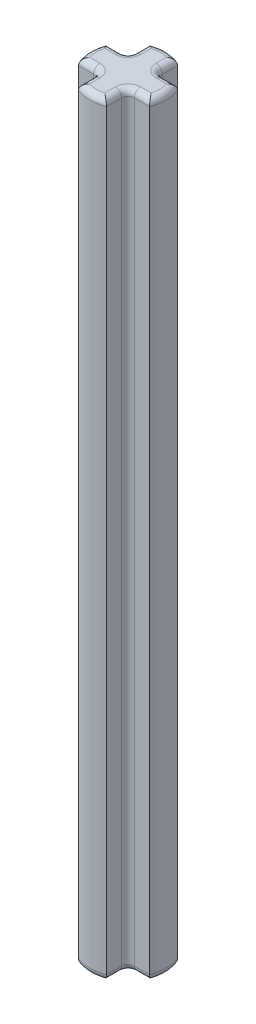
ISO-10303-21;
HEADER;
FILE_DESCRIPTION(('STEP AP214'),'2;1');
FILE_NAME('part.step','',(''),(''),'','','');
FILE_SCHEMA(('AUTOMOTIVE_DESIGN { 1 0 10303 214 1 1 1 1 }'));
ENDSEC;
DATA;
#1=APPLICATION_CONTEXT('core data for automotive mechanical design processes');
#2=APPLICATION_PROTOCOL_DEFINITION('international standard','automotive_design',2000,#1);
#3=PRODUCT_CONTEXT('',#1,'mechanical');
#4=PRODUCT('Part','Part','',(#3));
#5=PRODUCT_RELATED_PRODUCT_CATEGORY('part','',(#4));
#6=PRODUCT_DEFINITION_FORMATION('','',#4);
#7=PRODUCT_DEFINITION_CONTEXT('part definition',#1,'design');
#8=PRODUCT_DEFINITION('design','',#6,#7);
#9=PRODUCT_DEFINITION_SHAPE('','',#8);
#10=(LENGTH_UNIT() NAMED_UNIT(*) SI_UNIT(.MILLI.,.METRE.));
#11=(NAMED_UNIT(*) PLANE_ANGLE_UNIT() SI_UNIT($,.RADIAN.));
#12=(NAMED_UNIT(*) SI_UNIT($,.STERADIAN.) SOLID_ANGLE_UNIT());
#13=UNCERTAINTY_MEASURE_WITH_UNIT(LENGTH_MEASURE(1.E-05),#10,'distance_accuracy_value','');
#14=(GEOMETRIC_REPRESENTATION_CONTEXT(3) GLOBAL_UNCERTAINTY_ASSIGNED_CONTEXT((#13)) GLOBAL_UNIT_ASSIGNED_CONTEXT((#10,
#11,#12)) REPRESENTATION_CONTEXT('',''));
#15=CARTESIAN_POINT('',(0.,0.,0.));
#16=DIRECTION('',(0.,0.,1.));
#17=DIRECTION('',(1.,0.,0.));
#18=AXIS2_PLACEMENT_3D('',#15,#16,#17);
#19=CARTESIAN_POINT('',(0.,0.,0.));
#20=DIRECTION('',(0.,1.,0.));
#21=DIRECTION('',(0.,0.,1.));
#22=AXIS2_PLACEMENT_3D('',#19,#20,#21);
#23=PLANE('',#22);
#24=CARTESIAN_POINT('',(-1.28,0.,1.28));
#25=DIRECTION('',(0.,1.,0.));
#26=DIRECTION('',(0.,0.,1.));
#27=AXIS2_PLACEMENT_3D('',#24,#25,#26);
#28=CIRCLE('',#27,0.8);
#29=CARTESIAN_POINT('',(-1.28,0.,0.480000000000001));
#30=VERTEX_POINT('',#29);
#31=CARTESIAN_POINT('',(-0.48,0.,1.28));
#32=VERTEX_POINT('',#31);
#33=EDGE_CURVE('E262',#30,#32,#28,.F.);
#34=ORIENTED_EDGE('',*,*,#33,.F.);
#35=DIRECTION('',(1.,0.,0.));
#36=VECTOR('',#35,1.);
#37=CARTESIAN_POINT('',(0.,0.,0.480000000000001));
#38=LINE('',#37,#36);
#39=CARTESIAN_POINT('',(-1.94154577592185,0.,0.480000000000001));
#40=VERTEX_POINT('',#39);
#41=EDGE_CURVE('E324',#30,#40,#38,.F.);
#42=ORIENTED_EDGE('',*,*,#41,.T.);
#43=CARTESIAN_POINT('',(0.,0.,0.));
#44=DIRECTION('',(0.,1.,0.));
#45=DIRECTION('',(0.,0.,1.));
#46=AXIS2_PLACEMENT_3D('',#43,#44,#45);
#47=CIRCLE('',#46,2.);
#48=CARTESIAN_POINT('',(-1.94154577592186,0.,-0.48));
#49=VERTEX_POINT('',#48);
#50=EDGE_CURVE('E313',#40,#49,#47,.F.);
#51=ORIENTED_EDGE('',*,*,#50,.T.);
#52=DIRECTION('',(-1.,0.,0.));
#53=VECTOR('',#52,1.);
#54=CARTESIAN_POINT('',(0.,0.,-0.48));
#55=LINE('',#54,#53);
#56=CARTESIAN_POINT('',(-1.28,0.,-0.48));
#57=VERTEX_POINT('',#56);
#58=EDGE_CURVE('E301',#49,#57,#55,.F.);
#59=ORIENTED_EDGE('',*,*,#58,.T.);
#60=CARTESIAN_POINT('',(-1.28,0.,-1.28));
#61=DIRECTION('',(0.,1.,0.));
#62=DIRECTION('',(0.,0.,1.));
#63=AXIS2_PLACEMENT_3D('',#60,#61,#62);
#64=CIRCLE('',#63,0.8);
#65=CARTESIAN_POINT('',(-0.48,0.,-1.28));
#66=VERTEX_POINT('',#65);
#67=EDGE_CURVE('E298',#66,#57,#64,.F.);
#68=ORIENTED_EDGE('',*,*,#67,.F.);
#69=DIRECTION('',(0.,0.,1.));
#70=VECTOR('',#69,1.);
#71=CARTESIAN_POINT('',(-0.48,0.,0.));
#72=LINE('',#71,#70);
#73=CARTESIAN_POINT('',(-0.48,0.,-1.94154577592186));
#74=VERTEX_POINT('',#73);
#75=EDGE_CURVE('E289',#66,#74,#72,.F.);
#76=ORIENTED_EDGE('',*,*,#75,.T.);
#77=CARTESIAN_POINT('',(0.,0.,0.));
#78=DIRECTION('',(0.,1.,0.));
#79=DIRECTION('',(0.,0.,1.));
#80=AXIS2_PLACEMENT_3D('',#77,#78,#79);
#81=CIRCLE('',#80,2.);
#82=CARTESIAN_POINT('',(0.480000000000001,0.,-1.94154577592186));
#83=VERTEX_POINT('',#82);
#84=EDGE_CURVE('E294',#74,#83,#81,.F.);
#85=ORIENTED_EDGE('',*,*,#84,.T.);
#86=DIRECTION('',(0.,0.,-1.));
#87=VECTOR('',#86,1.);
#88=CARTESIAN_POINT('',(0.480000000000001,0.,0.));
#89=LINE('',#88,#87);
#90=CARTESIAN_POINT('',(0.480000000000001,0.,-1.28));
#91=VERTEX_POINT('',#90);
#92=EDGE_CURVE('E296',#83,#91,#89,.F.);
#93=ORIENTED_EDGE('',*,*,#92,.T.);
#94=CARTESIAN_POINT('',(1.28,0.,-1.28));
#95=DIRECTION('',(0.,1.,0.));
#96=DIRECTION('',(0.,0.,1.));
#97=AXIS2_PLACEMENT_3D('',#94,#95,#96);
#98=CIRCLE('',#97,0.8);
#99=CARTESIAN_POINT('',(1.28,0.,-0.48));
#100=VERTEX_POINT('',#99);
#101=EDGE_CURVE('E304',#100,#91,#98,.F.);
#102=ORIENTED_EDGE('',*,*,#101,.F.);
#103=DIRECTION('',(-1.,0.,0.));
#104=VECTOR('',#103,1.);
#105=CARTESIAN_POINT('',(0.,0.,-0.48));
#106=LINE('',#105,#104);
#107=CARTESIAN_POINT('',(1.94154577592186,0.,-0.48));
#108=VERTEX_POINT('',#107);
#109=EDGE_CURVE('E307',#100,#108,#106,.F.);
#110=ORIENTED_EDGE('',*,*,#109,.T.);
#111=CARTESIAN_POINT('',(0.,0.,0.));
#112=DIRECTION('',(0.,1.,0.));
#113=DIRECTION('',(0.,0.,1.));
#114=AXIS2_PLACEMENT_3D('',#111,#112,#113);
#115=CIRCLE('',#114,2.);
#116=CARTESIAN_POINT('',(1.94154577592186,0.,0.480000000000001));
#117=VERTEX_POINT('',#116);
#118=EDGE_CURVE('E309',#108,#117,#115,.F.);
#119=ORIENTED_EDGE('',*,*,#118,.T.);
#120=DIRECTION('',(1.,0.,0.));
#121=VECTOR('',#120,1.);
#122=CARTESIAN_POINT('',(0.,0.,0.480000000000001));
#123=LINE('',#122,#121);
#124=CARTESIAN_POINT('',(1.28,0.,0.480000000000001));
#125=VERTEX_POINT('',#124);
#126=EDGE_CURVE('E311',#117,#125,#123,.F.);
#127=ORIENTED_EDGE('',*,*,#126,.T.);
#128=CARTESIAN_POINT('',(1.28,0.,1.28));
#129=DIRECTION('',(0.,1.,0.));
#130=DIRECTION('',(0.,0.,1.));
#131=AXIS2_PLACEMENT_3D('',#128,#129,#130);
#132=CIRCLE('',#131,0.8);
#133=CARTESIAN_POINT('',(0.480000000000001,0.,1.28));
#134=VERTEX_POINT('',#133);
#135=EDGE_CURVE('E315',#134,#125,#132,.F.);
#136=ORIENTED_EDGE('',*,*,#135,.F.);
#137=DIRECTION('',(0.,0.,-1.));
#138=VECTOR('',#137,1.);
#139=CARTESIAN_POINT('',(0.480000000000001,0.,0.));
#140=LINE('',#139,#138);
#141=CARTESIAN_POINT('',(0.480000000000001,0.,1.94154577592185));
#142=VERTEX_POINT('',#141);
#143=EDGE_CURVE('E318',#134,#142,#140,.F.);
#144=ORIENTED_EDGE('',*,*,#143,.T.);
#145=CARTESIAN_POINT('',(0.,0.,0.));
#146=DIRECTION('',(0.,1.,0.));
#147=DIRECTION('',(0.,0.,1.));
#148=AXIS2_PLACEMENT_3D('',#145,#146,#147);
#149=CIRCLE('',#148,2.);
#150=CARTESIAN_POINT('',(-0.48,0.,1.94154577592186));
#151=VERTEX_POINT('',#150);
#152=EDGE_CURVE('E320',#142,#151,#149,.F.);
#153=ORIENTED_EDGE('',*,*,#152,.T.);
#154=DIRECTION('',(0.,0.,1.));
#155=VECTOR('',#154,1.);
#156=CARTESIAN_POINT('',(-0.48,0.,0.));
#157=LINE('',#156,#155);
#158=EDGE_CURVE('E322',#151,#32,#157,.F.);
#159=ORIENTED_EDGE('',*,*,#158,.T.);
#160=EDGE_LOOP('',(#34,#42,#51,#59,#68,#76,#85,#93,#102,#110,#119,#127,#136,#144,#153,#159));
#161=FACE_BOUND('',#160,.T.);
#162=ADVANCED_FACE('F36',(#161),#23,.F.);
#163=CARTESIAN_POINT('',(-0.88,48.,-2.23284571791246));
#164=DIRECTION('',(1.,0.,0.));
#165=DIRECTION('',(0.,0.,-1.));
#166=AXIS2_PLACEMENT_3D('',#163,#164,#165);
#167=PLANE('',#166);
#168=DIRECTION('',(0.,-1.,0.));
#169=VECTOR('',#168,1.);
#170=CARTESIAN_POINT('',(-0.88,48.,-2.23284571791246));
#171=LINE('',#170,#169);
#172=CARTESIAN_POINT('',(-0.88,47.6,-2.23284571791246));
#173=VERTEX_POINT('',#172);
#174=CARTESIAN_POINT('',(-0.88,0.399999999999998,-2.23284571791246));
#175=VERTEX_POINT('',#174);
#176=EDGE_CURVE('E684',#173,#175,#171,.T.);
#177=ORIENTED_EDGE('',*,*,#176,.T.);
#178=DIRECTION('',(0.,0.,1.));
#179=VECTOR('',#178,1.);
#180=CARTESIAN_POINT('',(-0.88,0.399999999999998,-2.23284571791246));
#181=LINE('',#180,#179);
#182=CARTESIAN_POINT('',(-0.88,0.399999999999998,-1.28));
#183=VERTEX_POINT('',#182);
#184=EDGE_CURVE('E384',#175,#183,#181,.T.);
#185=ORIENTED_EDGE('',*,*,#184,.T.);
#186=DIRECTION('',(0.,-1.,0.));
#187=VECTOR('',#186,1.);
#188=CARTESIAN_POINT('',(-0.88,48.,-1.28));
#189=LINE('',#188,#187);
#190=CARTESIAN_POINT('',(-0.88,47.6,-1.28));
#191=VERTEX_POINT('',#190);
#192=EDGE_CURVE('E380',#183,#191,#189,.F.);
#193=ORIENTED_EDGE('',*,*,#192,.T.);
#194=DIRECTION('',(0.,0.,1.));
#195=VECTOR('',#194,1.);
#196=CARTESIAN_POINT('',(-0.88,47.6,-2.23284571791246));
#197=LINE('',#196,#195);
#198=EDGE_CURVE('E382',#191,#173,#197,.F.);
#199=ORIENTED_EDGE('',*,*,#198,.T.);
#200=EDGE_LOOP('',(#177,#185,#193,#199));
#201=FACE_BOUND('',#200,.T.);
#202=ADVANCED_FACE('F777',(#201),#167,.F.);
#203=CARTESIAN_POINT('',(-2.23284571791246,48.,-0.88));
#204=DIRECTION('',(0.,0.,1.));
#205=DIRECTION('',(1.,0.,0.));
#206=AXIS2_PLACEMENT_3D('',#203,#204,#205);
#207=PLANE('',#206);
#208=DIRECTION('',(0.,-1.,0.));
#209=VECTOR('',#208,1.);
#210=CARTESIAN_POINT('',(-1.28,0.,-0.88));
#211=LINE('',#210,#209);
#212=CARTESIAN_POINT('',(-1.28,47.6,-0.88));
#213=VERTEX_POINT('',#212);
#214=CARTESIAN_POINT('',(-1.28,0.399999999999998,-0.88));
#215=VERTEX_POINT('',#214);
#216=EDGE_CURVE('E272',#213,#215,#211,.T.);
#217=ORIENTED_EDGE('',*,*,#216,.T.);
#218=DIRECTION('',(-1.,0.,0.));
#219=VECTOR('',#218,1.);
#220=CARTESIAN_POINT('',(-2.23284571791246,0.399999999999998,-0.88));
#221=LINE('',#220,#219);
#222=CARTESIAN_POINT('',(-2.23284571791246,0.399999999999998,-0.88));
#223=VERTEX_POINT('',#222);
#224=EDGE_CURVE('E271',#215,#223,#221,.T.);
#225=ORIENTED_EDGE('',*,*,#224,.T.);
#226=DIRECTION('',(0.,-1.,0.));
#227=VECTOR('',#226,1.);
#228=CARTESIAN_POINT('',(-2.23284571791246,48.,-0.88));
#229=LINE('',#228,#227);
#230=CARTESIAN_POINT('',(-2.23284571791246,47.6,-0.88));
#231=VERTEX_POINT('',#230);
#232=EDGE_CURVE('E254',#231,#223,#229,.T.);
#233=ORIENTED_EDGE('',*,*,#232,.F.);
#234=DIRECTION('',(-1.,0.,0.));
#235=VECTOR('',#234,1.);
#236=CARTESIAN_POINT('',(-0.88,47.6,-0.88));
#237=LINE('',#236,#235);
#238=EDGE_CURVE('E268',#231,#213,#237,.F.);
#239=ORIENTED_EDGE('',*,*,#238,.T.);
#240=EDGE_LOOP('',(#217,#225,#233,#239));
#241=FACE_BOUND('',#240,.T.);
#242=ADVANCED_FACE('F266',(#241),#207,.F.);
#243=CARTESIAN_POINT('',(0.,48.,0.));
#244=DIRECTION('',(0.,-1.,0.));
#245=DIRECTION('',(0.,0.,-1.));
#246=AXIS2_PLACEMENT_3D('',#243,#244,#245);
#247=CYLINDRICAL_SURFACE('',#246,2.4);
#248=ORIENTED_EDGE('',*,*,#232,.T.);
#249=CARTESIAN_POINT('',(0.,0.399999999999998,0.));
#250=DIRECTION('',(0.,1.,0.));
#251=DIRECTION('',(0.,0.,1.));
#252=AXIS2_PLACEMENT_3D('',#249,#250,#251);
#253=CIRCLE('',#252,2.4);
#254=CARTESIAN_POINT('',(-2.23284571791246,0.399999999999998,0.880000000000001));
#255=VERTEX_POINT('',#254);
#256=EDGE_CURVE('E261',#223,#255,#253,.T.);
#257=ORIENTED_EDGE('',*,*,#256,.T.);
#258=DIRECTION('',(0.,-1.,0.));
#259=VECTOR('',#258,1.);
#260=CARTESIAN_POINT('',(-2.23284571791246,48.,0.880000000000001));
#261=LINE('',#260,#259);
#262=CARTESIAN_POINT('',(-2.23284571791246,47.6,0.880000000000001));
#263=VERTEX_POINT('',#262);
#264=EDGE_CURVE('E256',#263,#255,#261,.T.);
#265=ORIENTED_EDGE('',*,*,#264,.F.);
#266=CARTESIAN_POINT('',(0.,47.6,0.));
#267=DIRECTION('',(0.,1.,0.));
#268=DIRECTION('',(0.,0.,1.));
#269=AXIS2_PLACEMENT_3D('',#266,#267,#268);
#270=CIRCLE('',#269,2.4);
#271=EDGE_CURVE('E251',#263,#231,#270,.F.);
#272=ORIENTED_EDGE('',*,*,#271,.T.);
#273=EDGE_LOOP('',(#248,#257,#265,#272));
#274=FACE_BOUND('',#273,.T.);
#275=ADVANCED_FACE('F253',(#274),#247,.T.);
#276=CARTESIAN_POINT('',(-0.88,48.,0.880000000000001));
#277=DIRECTION('',(0.,0.,-1.));
#278=DIRECTION('',(-1.,0.,0.));
#279=AXIS2_PLACEMENT_3D('',#276,#277,#278);
#280=PLANE('',#279);
#281=ORIENTED_EDGE('',*,*,#264,.T.);
#282=DIRECTION('',(1.,0.,0.));
#283=VECTOR('',#282,1.);
#284=CARTESIAN_POINT('',(-0.88,0.399999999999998,0.880000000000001));
#285=LINE('',#284,#283);
#286=CARTESIAN_POINT('',(-1.28,0.399999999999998,0.880000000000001));
#287=VERTEX_POINT('',#286);
#288=EDGE_CURVE('E333',#255,#287,#285,.T.);
#289=ORIENTED_EDGE('',*,*,#288,.T.);
#290=DIRECTION('',(0.,-1.,0.));
#291=VECTOR('',#290,1.);
#292=CARTESIAN_POINT('',(-1.28,48.,0.880000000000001));
#293=LINE('',#292,#291);
#294=CARTESIAN_POINT('',(-1.28,47.6,0.880000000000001));
#295=VERTEX_POINT('',#294);
#296=EDGE_CURVE('E329',#287,#295,#293,.F.);
#297=ORIENTED_EDGE('',*,*,#296,.T.);
#298=DIRECTION('',(1.,0.,0.));
#299=VECTOR('',#298,1.);
#300=CARTESIAN_POINT('',(-2.23284571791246,47.6,0.880000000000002));
#301=LINE('',#300,#299);
#302=EDGE_CURVE('E331',#295,#263,#301,.F.);
#303=ORIENTED_EDGE('',*,*,#302,.T.);
#304=EDGE_LOOP('',(#281,#289,#297,#303));
#305=FACE_BOUND('',#304,.T.);
#306=ADVANCED_FACE('F710',(#305),#280,.F.);
#307=CARTESIAN_POINT('',(-0.88,48.,0.880000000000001));
#308=DIRECTION('',(1.,0.,0.));
#309=DIRECTION('',(0.,0.,-1.));
#310=AXIS2_PLACEMENT_3D('',#307,#308,#309);
#311=PLANE('',#310);
#312=DIRECTION('',(0.,-1.,0.));
#313=VECTOR('',#312,1.);
#314=CARTESIAN_POINT('',(-0.88,0.,1.28));
#315=LINE('',#314,#313);
#316=CARTESIAN_POINT('',(-0.88,47.6,1.28));
#317=VERTEX_POINT('',#316);
#318=CARTESIAN_POINT('',(-0.88,0.399999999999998,1.28));
#319=VERTEX_POINT('',#318);
#320=EDGE_CURVE('E335',#317,#319,#315,.T.);
#321=ORIENTED_EDGE('',*,*,#320,.T.);
#322=DIRECTION('',(0.,0.,1.));
#323=VECTOR('',#322,1.);
#324=CARTESIAN_POINT('',(-0.88,0.399999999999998,0.880000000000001));
#325=LINE('',#324,#323);
#326=CARTESIAN_POINT('',(-0.88,0.399999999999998,2.23284571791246));
#327=VERTEX_POINT('',#326);
#328=EDGE_CURVE('E339',#319,#327,#325,.T.);
#329=ORIENTED_EDGE('',*,*,#328,.T.);
#330=DIRECTION('',(0.,-1.,0.));
#331=VECTOR('',#330,1.);
#332=CARTESIAN_POINT('',(-0.88,48.,2.23284571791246));
#333=LINE('',#332,#331);
#334=CARTESIAN_POINT('',(-0.88,47.6,2.23284571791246));
#335=VERTEX_POINT('',#334);
#336=EDGE_CURVE('E705',#335,#327,#333,.T.);
#337=ORIENTED_EDGE('',*,*,#336,.F.);
#338=DIRECTION('',(0.,0.,1.));
#339=VECTOR('',#338,1.);
#340=CARTESIAN_POINT('',(-0.88,47.6,0.880000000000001));
#341=LINE('',#340,#339);
#342=EDGE_CURVE('E337',#335,#317,#341,.F.);
#343=ORIENTED_EDGE('',*,*,#342,.T.);
#344=EDGE_LOOP('',(#321,#329,#337,#343));
#345=FACE_BOUND('',#344,.T.);
#346=ADVANCED_FACE('F808',(#345),#311,.F.);
#347=CARTESIAN_POINT('',(0.,48.,0.));
#348=DIRECTION('',(0.,-1.,0.));
#349=DIRECTION('',(0.,0.,-1.));
#350=AXIS2_PLACEMENT_3D('',#347,#348,#349);
#351=CYLINDRICAL_SURFACE('',#350,2.4);
#352=ORIENTED_EDGE('',*,*,#336,.T.);
#353=CARTESIAN_POINT('',(0.,0.399999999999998,0.));
#354=DIRECTION('',(0.,1.,0.));
#355=DIRECTION('',(0.,0.,1.));
#356=AXIS2_PLACEMENT_3D('',#353,#354,#355);
#357=CIRCLE('',#356,2.4);
#358=CARTESIAN_POINT('',(0.88,0.399999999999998,2.23284571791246));
#359=VERTEX_POINT('',#358);
#360=EDGE_CURVE('E344',#327,#359,#357,.T.);
#361=ORIENTED_EDGE('',*,*,#360,.T.);
#362=DIRECTION('',(0.,-1.,0.));
#363=VECTOR('',#362,1.);
#364=CARTESIAN_POINT('',(0.88,48.,2.23284571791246));
#365=LINE('',#364,#363);
#366=CARTESIAN_POINT('',(0.88,47.6,2.23284571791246));
#367=VERTEX_POINT('',#366);
#368=EDGE_CURVE('E702',#367,#359,#365,.T.);
#369=ORIENTED_EDGE('',*,*,#368,.F.);
#370=CARTESIAN_POINT('',(0.,47.6,0.));
#371=DIRECTION('',(0.,1.,0.));
#372=DIRECTION('',(0.,0.,1.));
#373=AXIS2_PLACEMENT_3D('',#370,#371,#372);
#374=CIRCLE('',#373,2.4);
#375=EDGE_CURVE('E342',#367,#335,#374,.F.);
#376=ORIENTED_EDGE('',*,*,#375,.T.);
#377=EDGE_LOOP('',(#352,#361,#369,#376));
#378=FACE_BOUND('',#377,.T.);
#379=ADVANCED_FACE('F804',(#378),#351,.T.);
#380=CARTESIAN_POINT('',(0.880000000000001,48.,2.23284571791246));
#381=DIRECTION('',(-1.,0.,0.));
#382=DIRECTION('',(0.,0.,1.));
#383=AXIS2_PLACEMENT_3D('',#380,#381,#382);
#384=PLANE('',#383);
#385=ORIENTED_EDGE('',*,*,#368,.T.);
#386=DIRECTION('',(0.,0.,-1.));
#387=VECTOR('',#386,1.);
#388=CARTESIAN_POINT('',(0.880000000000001,0.399999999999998,2.23284571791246));
#389=LINE('',#388,#387);
#390=CARTESIAN_POINT('',(0.880000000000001,0.399999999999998,1.28));
#391=VERTEX_POINT('',#390);
#392=EDGE_CURVE('E350',#359,#391,#389,.T.);
#393=ORIENTED_EDGE('',*,*,#392,.T.);
#394=DIRECTION('',(0.,-1.,0.));
#395=VECTOR('',#394,1.);
#396=CARTESIAN_POINT('',(0.880000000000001,48.,1.28));
#397=LINE('',#396,#395);
#398=CARTESIAN_POINT('',(0.880000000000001,47.6,1.28));
#399=VERTEX_POINT('',#398);
#400=EDGE_CURVE('E346',#391,#399,#397,.F.);
#401=ORIENTED_EDGE('',*,*,#400,.T.);
#402=DIRECTION('',(0.,0.,-1.));
#403=VECTOR('',#402,1.);
#404=CARTESIAN_POINT('',(0.880000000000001,47.6,2.23284571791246));
#405=LINE('',#404,#403);
#406=EDGE_CURVE('E348',#399,#367,#405,.F.);
#407=ORIENTED_EDGE('',*,*,#406,.T.);
#408=EDGE_LOOP('',(#385,#393,#401,#407));
#409=FACE_BOUND('',#408,.T.);
#410=ADVANCED_FACE('F800',(#409),#384,.F.);
#411=CARTESIAN_POINT('',(2.23284571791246,48.,0.880000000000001));
#412=DIRECTION('',(0.,0.,-1.));
#413=DIRECTION('',(-1.,0.,0.));
#414=AXIS2_PLACEMENT_3D('',#411,#412,#413);
#415=PLANE('',#414);
#416=DIRECTION('',(0.,-1.,0.));
#417=VECTOR('',#416,1.);
#418=CARTESIAN_POINT('',(1.28,0.,0.880000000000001));
#419=LINE('',#418,#417);
#420=CARTESIAN_POINT('',(1.28,47.6,0.880000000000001));
#421=VERTEX_POINT('',#420);
#422=CARTESIAN_POINT('',(1.28,0.399999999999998,0.880000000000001));
#423=VERTEX_POINT('',#422);
#424=EDGE_CURVE('E352',#421,#423,#419,.T.);
#425=ORIENTED_EDGE('',*,*,#424,.T.);
#426=DIRECTION('',(1.,0.,0.));
#427=VECTOR('',#426,1.);
#428=CARTESIAN_POINT('',(2.23284571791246,0.399999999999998,0.880000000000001));
#429=LINE('',#428,#427);
#430=CARTESIAN_POINT('',(2.23284571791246,0.399999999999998,0.880000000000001));
#431=VERTEX_POINT('',#430);
#432=EDGE_CURVE('E356',#423,#431,#429,.T.);
#433=ORIENTED_EDGE('',*,*,#432,.T.);
#434=DIRECTION('',(0.,-1.,0.));
#435=VECTOR('',#434,1.);
#436=CARTESIAN_POINT('',(2.23284571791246,48.,0.880000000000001));
#437=LINE('',#436,#435);
#438=CARTESIAN_POINT('',(2.23284571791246,47.6,0.880000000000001));
#439=VERTEX_POINT('',#438);
#440=EDGE_CURVE('E699',#439,#431,#437,.T.);
#441=ORIENTED_EDGE('',*,*,#440,.F.);
#442=DIRECTION('',(1.,0.,0.));
#443=VECTOR('',#442,1.);
#444=CARTESIAN_POINT('',(0.880000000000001,47.6,0.880000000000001));
#445=LINE('',#444,#443);
#446=EDGE_CURVE('E354',#439,#421,#445,.F.);
#447=ORIENTED_EDGE('',*,*,#446,.T.);
#448=EDGE_LOOP('',(#425,#433,#441,#447));
#449=FACE_BOUND('',#448,.T.);
#450=ADVANCED_FACE('F796',(#449),#415,.F.);
#451=CARTESIAN_POINT('',(0.,48.,0.));
#452=DIRECTION('',(0.,-1.,0.));
#453=DIRECTION('',(0.,0.,-1.));
#454=AXIS2_PLACEMENT_3D('',#451,#452,#453);
#455=CYLINDRICAL_SURFACE('',#454,2.4);
#456=ORIENTED_EDGE('',*,*,#440,.T.);
#457=CARTESIAN_POINT('',(0.,0.399999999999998,0.));
#458=DIRECTION('',(0.,1.,0.));
#459=DIRECTION('',(0.,0.,1.));
#460=AXIS2_PLACEMENT_3D('',#457,#458,#459);
#461=CIRCLE('',#460,2.4);
#462=CARTESIAN_POINT('',(2.23284571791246,0.399999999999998,-0.88));
#463=VERTEX_POINT('',#462);
#464=EDGE_CURVE('E361',#431,#463,#461,.T.);
#465=ORIENTED_EDGE('',*,*,#464,.T.);
#466=DIRECTION('',(0.,-1.,0.));
#467=VECTOR('',#466,1.);
#468=CARTESIAN_POINT('',(2.23284571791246,48.,-0.88));
#469=LINE('',#468,#467);
#470=CARTESIAN_POINT('',(2.23284571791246,47.6,-0.88));
#471=VERTEX_POINT('',#470);
#472=EDGE_CURVE('E694',#471,#463,#469,.T.);
#473=ORIENTED_EDGE('',*,*,#472,.F.);
#474=CARTESIAN_POINT('',(0.,47.6,0.));
#475=DIRECTION('',(0.,1.,0.));
#476=DIRECTION('',(0.,0.,1.));
#477=AXIS2_PLACEMENT_3D('',#474,#475,#476);
#478=CIRCLE('',#477,2.4);
#479=EDGE_CURVE('E359',#471,#439,#478,.F.);
#480=ORIENTED_EDGE('',*,*,#479,.T.);
#481=EDGE_LOOP('',(#456,#465,#473,#480));
#482=FACE_BOUND('',#481,.T.);
#483=ADVANCED_FACE('F792',(#482),#455,.T.);
#484=CARTESIAN_POINT('',(0.880000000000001,48.,-0.88));
#485=DIRECTION('',(0.,0.,1.));
#486=DIRECTION('',(1.,0.,0.));
#487=AXIS2_PLACEMENT_3D('',#484,#485,#486);
#488=PLANE('',#487);
#489=ORIENTED_EDGE('',*,*,#472,.T.);
#490=DIRECTION('',(-1.,0.,0.));
#491=VECTOR('',#490,1.);
#492=CARTESIAN_POINT('',(0.880000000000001,0.399999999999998,-0.88));
#493=LINE('',#492,#491);
#494=CARTESIAN_POINT('',(1.28,0.399999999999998,-0.88));
#495=VERTEX_POINT('',#494);
#496=EDGE_CURVE('E367',#463,#495,#493,.T.);
#497=ORIENTED_EDGE('',*,*,#496,.T.);
#498=DIRECTION('',(0.,-1.,0.));
#499=VECTOR('',#498,1.);
#500=CARTESIAN_POINT('',(1.28,48.,-0.88));
#501=LINE('',#500,#499);
#502=CARTESIAN_POINT('',(1.28,47.6,-0.88));
#503=VERTEX_POINT('',#502);
#504=EDGE_CURVE('E363',#495,#503,#501,.F.);
#505=ORIENTED_EDGE('',*,*,#504,.T.);
#506=DIRECTION('',(-1.,0.,0.));
#507=VECTOR('',#506,1.);
#508=CARTESIAN_POINT('',(2.23284571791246,47.6,-0.88));
#509=LINE('',#508,#507);
#510=EDGE_CURVE('E365',#503,#471,#509,.F.);
#511=ORIENTED_EDGE('',*,*,#510,.T.);
#512=EDGE_LOOP('',(#489,#497,#505,#511));
#513=FACE_BOUND('',#512,.T.);
#514=ADVANCED_FACE('F789',(#513),#488,.F.);
#515=CARTESIAN_POINT('',(0.880000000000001,48.,-0.88));
#516=DIRECTION('',(-1.,0.,0.));
#517=DIRECTION('',(0.,0.,1.));
#518=AXIS2_PLACEMENT_3D('',#515,#516,#517);
#519=PLANE('',#518);
#520=DIRECTION('',(0.,-1.,0.));
#521=VECTOR('',#520,1.);
#522=CARTESIAN_POINT('',(0.880000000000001,0.,-1.28));
#523=LINE('',#522,#521);
#524=CARTESIAN_POINT('',(0.880000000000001,47.6,-1.28));
#525=VERTEX_POINT('',#524);
#526=CARTESIAN_POINT('',(0.880000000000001,0.399999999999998,-1.28));
#527=VERTEX_POINT('',#526);
#528=EDGE_CURVE('E369',#525,#527,#523,.T.);
#529=ORIENTED_EDGE('',*,*,#528,.T.);
#530=DIRECTION('',(0.,0.,-1.));
#531=VECTOR('',#530,1.);
#532=CARTESIAN_POINT('',(0.880000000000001,0.399999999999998,-0.88));
#533=LINE('',#532,#531);
#534=CARTESIAN_POINT('',(0.880000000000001,0.399999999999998,-2.23284571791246));
#535=VERTEX_POINT('',#534);
#536=EDGE_CURVE('E373',#527,#535,#533,.T.);
#537=ORIENTED_EDGE('',*,*,#536,.T.);
#538=DIRECTION('',(0.,-1.,0.));
#539=VECTOR('',#538,1.);
#540=CARTESIAN_POINT('',(0.880000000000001,48.,-2.23284571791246));
#541=LINE('',#540,#539);
#542=CARTESIAN_POINT('',(0.880000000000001,47.6,-2.23284571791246));
#543=VERTEX_POINT('',#542);
#544=EDGE_CURVE('E688',#543,#535,#541,.T.);
#545=ORIENTED_EDGE('',*,*,#544,.F.);
#546=DIRECTION('',(0.,0.,-1.));
#547=VECTOR('',#546,1.);
#548=CARTESIAN_POINT('',(0.880000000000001,47.6,-0.88));
#549=LINE('',#548,#547);
#550=EDGE_CURVE('E371',#543,#525,#549,.F.);
#551=ORIENTED_EDGE('',*,*,#550,.T.);
#552=EDGE_LOOP('',(#529,#537,#545,#551));
#553=FACE_BOUND('',#552,.T.);
#554=ADVANCED_FACE('F730',(#553),#519,.F.);
#555=CARTESIAN_POINT('',(0.,48.,0.));
#556=DIRECTION('',(0.,-1.,0.));
#557=DIRECTION('',(0.,0.,-1.));
#558=AXIS2_PLACEMENT_3D('',#555,#556,#557);
#559=CYLINDRICAL_SURFACE('',#558,2.4);
#560=ORIENTED_EDGE('',*,*,#544,.T.);
#561=CARTESIAN_POINT('',(0.,0.399999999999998,0.));
#562=DIRECTION('',(0.,1.,0.));
#563=DIRECTION('',(0.,0.,1.));
#564=AXIS2_PLACEMENT_3D('',#561,#562,#563);
#565=CIRCLE('',#564,2.4);
#566=EDGE_CURVE('E378',#535,#175,#565,.T.);
#567=ORIENTED_EDGE('',*,*,#566,.T.);
#568=ORIENTED_EDGE('',*,*,#176,.F.);
#569=CARTESIAN_POINT('',(0.,47.6,0.));
#570=DIRECTION('',(0.,1.,0.));
#571=DIRECTION('',(0.,0.,1.));
#572=AXIS2_PLACEMENT_3D('',#569,#570,#571);
#573=CIRCLE('',#572,2.4);
#574=EDGE_CURVE('E376',#173,#543,#573,.F.);
#575=ORIENTED_EDGE('',*,*,#574,.T.);
#576=EDGE_LOOP('',(#560,#567,#568,#575));
#577=FACE_BOUND('',#576,.T.);
#578=ADVANCED_FACE('F734',(#577),#559,.T.);
#579=CARTESIAN_POINT('',(0.,48.,0.));
#580=DIRECTION('',(0.,1.,0.));
#581=DIRECTION('',(0.,0.,1.));
#582=AXIS2_PLACEMENT_3D('',#579,#580,#581);
#583=PLANE('',#582);
#584=CARTESIAN_POINT('',(0.,48.,0.));
#585=DIRECTION('',(0.,1.,0.));
#586=DIRECTION('',(0.,0.,1.));
#587=AXIS2_PLACEMENT_3D('',#584,#585,#586);
#588=CIRCLE('',#587,2.);
#589=CARTESIAN_POINT('',(1.94154577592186,48.,0.480000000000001));
#590=VERTEX_POINT('',#589);
#591=CARTESIAN_POINT('',(1.94154577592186,48.,-0.48));
#592=VERTEX_POINT('',#591);
#593=EDGE_CURVE('E62',#590,#592,#588,.T.);
#594=ORIENTED_EDGE('',*,*,#593,.T.);
#595=DIRECTION('',(-1.,0.,0.));
#596=VECTOR('',#595,1.);
#597=CARTESIAN_POINT('',(0.880000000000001,48.,-0.48));
#598=LINE('',#597,#596);
#599=CARTESIAN_POINT('',(1.28,48.,-0.48));
#600=VERTEX_POINT('',#599);
#601=EDGE_CURVE('E11',#592,#600,#598,.T.);
#602=ORIENTED_EDGE('',*,*,#601,.T.);
#603=CARTESIAN_POINT('',(1.28,48.,-1.28));
#604=DIRECTION('',(0.,1.,0.));
#605=DIRECTION('',(0.,0.,1.));
#606=AXIS2_PLACEMENT_3D('',#603,#604,#605);
#607=CIRCLE('',#606,0.8);
#608=CARTESIAN_POINT('',(0.480000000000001,48.,-1.28));
#609=VERTEX_POINT('',#608);
#610=EDGE_CURVE('E51',#609,#600,#607,.T.);
#611=ORIENTED_EDGE('',*,*,#610,.F.);
#612=DIRECTION('',(0.,0.,-1.));
#613=VECTOR('',#612,1.);
#614=CARTESIAN_POINT('',(0.480000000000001,48.,-2.23284571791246));
#615=LINE('',#614,#613);
#616=CARTESIAN_POINT('',(0.480000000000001,48.,-1.94154577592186));
#617=VERTEX_POINT('',#616);
#618=EDGE_CURVE('E408',#609,#617,#615,.T.);
#619=ORIENTED_EDGE('',*,*,#618,.T.);
#620=CARTESIAN_POINT('',(0.,48.,0.));
#621=DIRECTION('',(0.,1.,0.));
#622=DIRECTION('',(0.,0.,1.));
#623=AXIS2_PLACEMENT_3D('',#620,#621,#622);
#624=CIRCLE('',#623,2.);
#625=CARTESIAN_POINT('',(-0.48,48.,-1.94154577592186));
#626=VERTEX_POINT('',#625);
#627=EDGE_CURVE('E396',#617,#626,#624,.T.);
#628=ORIENTED_EDGE('',*,*,#627,.T.);
#629=DIRECTION('',(0.,0.,1.));
#630=VECTOR('',#629,1.);
#631=CARTESIAN_POINT('',(-0.48,48.,-0.88));
#632=LINE('',#631,#630);
#633=CARTESIAN_POINT('',(-0.48,48.,-1.28));
#634=VERTEX_POINT('',#633);
#635=EDGE_CURVE('E389',#626,#634,#632,.T.);
#636=ORIENTED_EDGE('',*,*,#635,.T.);
#637=CARTESIAN_POINT('',(-1.28,48.,-1.28));
#638=DIRECTION('',(0.,1.,0.));
#639=DIRECTION('',(0.,0.,1.));
#640=AXIS2_PLACEMENT_3D('',#637,#638,#639);
#641=CIRCLE('',#640,0.8);
#642=CARTESIAN_POINT('',(-1.28,48.,-0.48));
#643=VERTEX_POINT('',#642);
#644=EDGE_CURVE('E386',#643,#634,#641,.T.);
#645=ORIENTED_EDGE('',*,*,#644,.F.);
#646=DIRECTION('',(-1.,0.,0.));
#647=VECTOR('',#646,1.);
#648=CARTESIAN_POINT('',(-2.23284571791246,48.,-0.48));
#649=LINE('',#648,#647);
#650=CARTESIAN_POINT('',(-1.94154577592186,48.,-0.48));
#651=VERTEX_POINT('',#650);
#652=EDGE_CURVE('E391',#643,#651,#649,.T.);
#653=ORIENTED_EDGE('',*,*,#652,.T.);
#654=CARTESIAN_POINT('',(0.,48.,0.));
#655=DIRECTION('',(0.,1.,0.));
#656=DIRECTION('',(0.,0.,1.));
#657=AXIS2_PLACEMENT_3D('',#654,#655,#656);
#658=CIRCLE('',#657,2.);
#659=CARTESIAN_POINT('',(-1.94154577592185,48.,0.480000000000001));
#660=VERTEX_POINT('',#659);
#661=EDGE_CURVE('E278',#651,#660,#658,.T.);
#662=ORIENTED_EDGE('',*,*,#661,.T.);
#663=DIRECTION('',(1.,0.,0.));
#664=VECTOR('',#663,1.);
#665=CARTESIAN_POINT('',(-0.88,48.,0.480000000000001));
#666=LINE('',#665,#664);
#667=CARTESIAN_POINT('',(-1.28,48.,0.480000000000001));
#668=VERTEX_POINT('',#667);
#669=EDGE_CURVE('E394',#660,#668,#666,.T.);
#670=ORIENTED_EDGE('',*,*,#669,.T.);
#671=CARTESIAN_POINT('',(-1.28,48.,1.28));
#672=DIRECTION('',(0.,1.,0.));
#673=DIRECTION('',(0.,0.,1.));
#674=AXIS2_PLACEMENT_3D('',#671,#672,#673);
#675=CIRCLE('',#674,0.8);
#676=CARTESIAN_POINT('',(-0.48,48.,1.28));
#677=VERTEX_POINT('',#676);
#678=EDGE_CURVE('E399',#677,#668,#675,.T.);
#679=ORIENTED_EDGE('',*,*,#678,.F.);
#680=DIRECTION('',(0.,0.,1.));
#681=VECTOR('',#680,1.);
#682=CARTESIAN_POINT('',(-0.48,48.,2.23284571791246));
#683=LINE('',#682,#681);
#684=CARTESIAN_POINT('',(-0.48,48.,1.94154577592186));
#685=VERTEX_POINT('',#684);
#686=EDGE_CURVE('E402',#677,#685,#683,.T.);
#687=ORIENTED_EDGE('',*,*,#686,.T.);
#688=CARTESIAN_POINT('',(0.,48.,0.));
#689=DIRECTION('',(0.,1.,0.));
#690=DIRECTION('',(0.,0.,1.));
#691=AXIS2_PLACEMENT_3D('',#688,#689,#690);
#692=CIRCLE('',#691,2.);
#693=CARTESIAN_POINT('',(0.48,48.,1.94154577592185));
#694=VERTEX_POINT('',#693);
#695=EDGE_CURVE('E404',#685,#694,#692,.T.);
#696=ORIENTED_EDGE('',*,*,#695,.T.);
#697=DIRECTION('',(0.,0.,-1.));
#698=VECTOR('',#697,1.);
#699=CARTESIAN_POINT('',(0.480000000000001,48.,0.880000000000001));
#700=LINE('',#699,#698);
#701=CARTESIAN_POINT('',(0.480000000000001,48.,1.28));
#702=VERTEX_POINT('',#701);
#703=EDGE_CURVE('E406',#694,#702,#700,.T.);
#704=ORIENTED_EDGE('',*,*,#703,.T.);
#705=CARTESIAN_POINT('',(1.28,48.,1.28));
#706=DIRECTION('',(0.,1.,0.));
#707=DIRECTION('',(0.,0.,1.));
#708=AXIS2_PLACEMENT_3D('',#705,#706,#707);
#709=CIRCLE('',#708,0.8);
#710=CARTESIAN_POINT('',(1.28,48.,0.480000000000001));
#711=VERTEX_POINT('',#710);
#712=EDGE_CURVE('E410',#711,#702,#709,.T.);
#713=ORIENTED_EDGE('',*,*,#712,.F.);
#714=DIRECTION('',(1.,0.,0.));
#715=VECTOR('',#714,1.);
#716=CARTESIAN_POINT('',(2.23284571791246,48.,0.480000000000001));
#717=LINE('',#716,#715);
#718=EDGE_CURVE('E413',#711,#590,#717,.T.);
#719=ORIENTED_EDGE('',*,*,#718,.T.);
#720=EDGE_LOOP('',(#594,#602,#611,#619,#628,#636,#645,#653,#662,#670,#679,#687,#696,#704,#713,#719));
#721=FACE_BOUND('',#720,.T.);
#722=ADVANCED_FACE('F784',(#721),#583,.T.);
#723=CARTESIAN_POINT('',(0.,47.6,0.480000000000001));
#724=DIRECTION('',(-1.,0.,0.));
#725=DIRECTION('',(0.,0.,1.));
#726=AXIS2_PLACEMENT_3D('',#723,#724,#725);
#727=CYLINDRICAL_SURFACE('',#726,0.4);
#728=CARTESIAN_POINT('',(1.28,47.6,0.480000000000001));
#729=DIRECTION('',(-1.,0.,0.));
#730=DIRECTION('',(0.,0.,1.));
#731=AXIS2_PLACEMENT_3D('',#728,#729,#730);
#732=CIRCLE('',#731,0.4);
#733=EDGE_CURVE('E677',#421,#711,#732,.T.);
#734=ORIENTED_EDGE('',*,*,#733,.F.);
#735=ORIENTED_EDGE('',*,*,#446,.F.);
#736=CARTESIAN_POINT('',(2.23284571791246,47.6,0.880000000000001));
#737=CARTESIAN_POINT('',(2.23286229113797,47.6196677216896,0.880027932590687));
#738=CARTESIAN_POINT('',(2.23185960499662,47.6393093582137,0.878551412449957));
#739=CARTESIAN_POINT('',(2.22795221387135,47.6778900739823,0.872817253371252));
#740=CARTESIAN_POINT('',(2.22505712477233,47.6968321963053,0.86857367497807));
#741=CARTESIAN_POINT('',(2.21750324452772,47.7335523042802,0.85753531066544));
#742=CARTESIAN_POINT('',(2.21284643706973,47.7513315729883,0.85074339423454));
#743=CARTESIAN_POINT('',(2.20197052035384,47.7853742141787,0.834948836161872));
#744=CARTESIAN_POINT('',(2.19574983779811,47.8016360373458,0.825943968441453));
#745=CARTESIAN_POINT('',(2.18156387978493,47.8332696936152,0.805515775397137));
#746=CARTESIAN_POINT('',(2.1735174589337,47.8485327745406,0.793981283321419));
#747=CARTESIAN_POINT('',(2.15618491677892,47.8768786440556,0.769295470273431));
#748=CARTESIAN_POINT('',(2.14689846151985,47.8899608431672,0.756143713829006));
#749=CARTESIAN_POINT('',(2.12572929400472,47.9158258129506,0.72638021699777));
#750=CARTESIAN_POINT('',(2.11366981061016,47.9282155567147,0.709553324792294));
#751=CARTESIAN_POINT('',(2.08850314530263,47.9499832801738,0.674765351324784));
#752=CARTESIAN_POINT('',(2.07539489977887,47.9593581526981,0.6568031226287));
#753=CARTESIAN_POINT('',(2.04585046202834,47.9766538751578,0.616725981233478));
#754=CARTESIAN_POINT('',(2.02925334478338,47.9839655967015,0.594467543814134));
#755=CARTESIAN_POINT('',(1.99535297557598,47.9945738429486,0.549587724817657));
#756=CARTESIAN_POINT('',(1.97805064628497,47.9978754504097,0.526966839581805));
#757=CARTESIAN_POINT('',(1.95507409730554,47.9996873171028,0.49733039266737));
#758=CARTESIAN_POINT('',(1.9495684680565,47.9999307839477,0.490258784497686));
#759=CARTESIAN_POINT('',(1.94321386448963,47.9999957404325,0.482131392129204));
#760=CARTESIAN_POINT('',(1.94237999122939,47.9999999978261,0.481065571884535));
#761=CARTESIAN_POINT('',(1.94154577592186,48.,0.480000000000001));
#762=B_SPLINE_CURVE_WITH_KNOTS('',3,(#736,#737,#738,#739,#740,#741,#742,#743,#744,#745,#746,
#747,#748,#749,#750,#751,#752,#753,#754,#755,#756,#757,#758,#759,#760,#761),.UNSPECIFIED.,.F.,
.F.,(4,2,2,2,2,2,2,2,2,2,2,2,4),(0.,0.0588812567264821,0.117465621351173,0.175984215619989,
0.234561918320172,0.296588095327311,0.358631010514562,0.430741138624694,0.502925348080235,
0.588744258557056,0.674454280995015,0.701345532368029,0.705405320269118),.UNSPECIFIED.);
#763=EDGE_CURVE('E41',#590,#439,#762,.F.);
#764=ORIENTED_EDGE('',*,*,#763,.F.);
#765=ORIENTED_EDGE('',*,*,#718,.F.);
#766=EDGE_LOOP('',(#734,#735,#764,#765));
#767=FACE_BOUND('',#766,.T.);
#768=ADVANCED_FACE('F38',(#767),#727,.T.);
#769=CARTESIAN_POINT('',(0.,47.6,0.));
#770=DIRECTION('',(0.,1.,0.));
#771=DIRECTION('',(0.,0.,1.));
#772=AXIS2_PLACEMENT_3D('',#769,#770,#771);
#773=TOROIDAL_SURFACE('',#772,2.,0.4);
#774=ORIENTED_EDGE('',*,*,#763,.T.);
#775=ORIENTED_EDGE('',*,*,#479,.F.);
#776=CARTESIAN_POINT('',(2.23284571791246,47.6,-0.88));
#777=CARTESIAN_POINT('',(2.23286229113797,47.6196677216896,-0.880027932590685));
#778=CARTESIAN_POINT('',(2.23185960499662,47.6393093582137,-0.878551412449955));
#779=CARTESIAN_POINT('',(2.22795221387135,47.6778900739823,-0.872817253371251));
#780=CARTESIAN_POINT('',(2.22505712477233,47.6968321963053,-0.868573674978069));
#781=CARTESIAN_POINT('',(2.21750324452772,47.7335523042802,-0.857535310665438));
#782=CARTESIAN_POINT('',(2.21284643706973,47.7513315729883,-0.850743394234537));
#783=CARTESIAN_POINT('',(2.20197052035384,47.7853742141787,-0.834948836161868));
#784=CARTESIAN_POINT('',(2.19574983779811,47.8016360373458,-0.825943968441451));
#785=CARTESIAN_POINT('',(2.18156387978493,47.8332696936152,-0.805515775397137));
#786=CARTESIAN_POINT('',(2.1735174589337,47.8485327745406,-0.793981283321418));
#787=CARTESIAN_POINT('',(2.15618491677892,47.8768786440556,-0.76929547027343));
#788=CARTESIAN_POINT('',(2.14689846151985,47.8899608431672,-0.756143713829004));
#789=CARTESIAN_POINT('',(2.12572929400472,47.9158258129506,-0.726380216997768));
#790=CARTESIAN_POINT('',(2.11366981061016,47.9282155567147,-0.709553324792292));
#791=CARTESIAN_POINT('',(2.08850314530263,47.9499832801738,-0.674765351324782));
#792=CARTESIAN_POINT('',(2.07539489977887,47.9593581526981,-0.656803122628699));
#793=CARTESIAN_POINT('',(2.04585046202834,47.9766538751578,-0.616725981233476));
#794=CARTESIAN_POINT('',(2.02925334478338,47.9839655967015,-0.594467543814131));
#795=CARTESIAN_POINT('',(1.99535297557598,47.9945738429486,-0.549587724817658));
#796=CARTESIAN_POINT('',(1.97805064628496,47.9978754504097,-0.526966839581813));
#797=CARTESIAN_POINT('',(1.95507409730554,47.9996873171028,-0.497330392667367));
#798=CARTESIAN_POINT('',(1.9495684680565,47.9999307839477,-0.490258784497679));
#799=CARTESIAN_POINT('',(1.94321386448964,47.9999957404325,-0.482131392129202));
#800=CARTESIAN_POINT('',(1.94237999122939,47.9999999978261,-0.481065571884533));
#801=CARTESIAN_POINT('',(1.94154577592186,48.,-0.48));
#802=B_SPLINE_CURVE_WITH_KNOTS('',3,(#776,#777,#778,#779,#780,#781,#782,#783,#784,#785,#786,
#787,#788,#789,#790,#791,#792,#793,#794,#795,#796,#797,#798,#799,#800,#801),.UNSPECIFIED.,.F.,
.F.,(4,2,2,2,2,2,2,2,2,2,2,2,4),(0.,0.0588812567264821,0.117465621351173,0.17598421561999,
0.234561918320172,0.296588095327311,0.358631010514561,0.430741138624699,0.502925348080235,
0.588744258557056,0.674454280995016,0.701345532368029,0.705405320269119),.UNSPECIFIED.);
#803=EDGE_CURVE('E671',#592,#471,#802,.F.);
#804=ORIENTED_EDGE('',*,*,#803,.F.);
#805=ORIENTED_EDGE('',*,*,#593,.F.);
#806=EDGE_LOOP('',(#774,#775,#804,#805));
#807=FACE_BOUND('',#806,.T.);
#808=ADVANCED_FACE('F661',(#807),#773,.T.);
#809=CARTESIAN_POINT('',(1.28,47.6,1.28));
#810=DIRECTION('',(0.,1.,0.));
#811=DIRECTION('',(0.,0.,1.));
#812=AXIS2_PLACEMENT_3D('',#809,#810,#811);
#813=TOROIDAL_SURFACE('',#812,0.8,0.4);
#814=ORIENTED_EDGE('',*,*,#733,.T.);
#815=ORIENTED_EDGE('',*,*,#712,.T.);
#816=CARTESIAN_POINT('',(0.480000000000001,47.6,1.28));
#817=DIRECTION('',(0.,0.,-1.));
#818=DIRECTION('',(-1.,0.,0.));
#819=AXIS2_PLACEMENT_3D('',#816,#817,#818);
#820=CIRCLE('',#819,0.4);
#821=EDGE_CURVE('E678',#399,#702,#820,.F.);
#822=ORIENTED_EDGE('',*,*,#821,.F.);
#823=CARTESIAN_POINT('',(1.28,47.6,1.28));
#824=DIRECTION('',(0.,1.,0.));
#825=DIRECTION('',(0.,0.,1.));
#826=AXIS2_PLACEMENT_3D('',#823,#824,#825);
#827=CIRCLE('',#826,0.4);
#828=EDGE_CURVE('E648',#421,#399,#827,.T.);
#829=ORIENTED_EDGE('',*,*,#828,.F.);
#830=EDGE_LOOP('',(#814,#815,#822,#829));
#831=FACE_BOUND('',#830,.T.);
#832=ADVANCED_FACE('F665',(#831),#813,.T.);
#833=CARTESIAN_POINT('',(0.,47.6,-0.48));
#834=DIRECTION('',(1.,0.,0.));
#835=DIRECTION('',(0.,0.,-1.));
#836=AXIS2_PLACEMENT_3D('',#833,#834,#835);
#837=CYLINDRICAL_SURFACE('',#836,0.4);
#838=ORIENTED_EDGE('',*,*,#803,.T.);
#839=ORIENTED_EDGE('',*,*,#510,.F.);
#840=CARTESIAN_POINT('',(1.28,47.6,-0.48));
#841=DIRECTION('',(-1.,0.,0.));
#842=DIRECTION('',(0.,0.,1.));
#843=AXIS2_PLACEMENT_3D('',#840,#841,#842);
#844=CIRCLE('',#843,0.4);
#845=EDGE_CURVE('E649',#600,#503,#844,.T.);
#846=ORIENTED_EDGE('',*,*,#845,.F.);
#847=ORIENTED_EDGE('',*,*,#601,.F.);
#848=EDGE_LOOP('',(#838,#839,#846,#847));
#849=FACE_BOUND('',#848,.T.);
#850=ADVANCED_FACE('F667',(#849),#837,.T.);
#851=CARTESIAN_POINT('',(0.480000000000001,47.6,0.));
#852=DIRECTION('',(0.,0.,1.));
#853=DIRECTION('',(1.,0.,0.));
#854=AXIS2_PLACEMENT_3D('',#851,#852,#853);
#855=CYLINDRICAL_SURFACE('',#854,0.4);
#856=ORIENTED_EDGE('',*,*,#821,.T.);
#857=ORIENTED_EDGE('',*,*,#703,.F.);
#858=CARTESIAN_POINT('',(0.88,47.6,2.23284571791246));
#859=CARTESIAN_POINT('',(0.880027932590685,47.6196677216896,2.23286229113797));
#860=CARTESIAN_POINT('',(0.878551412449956,47.6393093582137,2.23185960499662));
#861=CARTESIAN_POINT('',(0.872817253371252,47.6778900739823,2.22795221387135));
#862=CARTESIAN_POINT('',(0.86857367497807,47.6968321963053,2.22505712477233));
#863=CARTESIAN_POINT('',(0.857535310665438,47.7335523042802,2.21750324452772));
#864=CARTESIAN_POINT('',(0.850743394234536,47.7513315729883,2.21284643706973));
#865=CARTESIAN_POINT('',(0.834948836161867,47.7853742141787,2.20197052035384));
#866=CARTESIAN_POINT('',(0.825943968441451,47.8016360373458,2.19574983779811));
#867=CARTESIAN_POINT('',(0.805515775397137,47.8332696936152,2.18156387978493));
#868=CARTESIAN_POINT('',(0.793981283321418,47.8485327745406,2.1735174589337));
#869=CARTESIAN_POINT('',(0.76929547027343,47.8768786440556,2.15618491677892));
#870=CARTESIAN_POINT('',(0.756143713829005,47.8899608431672,2.14689846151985));
#871=CARTESIAN_POINT('',(0.726380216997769,47.9158258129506,2.12572929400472));
#872=CARTESIAN_POINT('',(0.709553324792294,47.9282155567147,2.11366981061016));
#873=CARTESIAN_POINT('',(0.674765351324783,47.9499832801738,2.08850314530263));
#874=CARTESIAN_POINT('',(0.6568031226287,47.9593581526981,2.07539489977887));
#875=CARTESIAN_POINT('',(0.616725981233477,47.9766538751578,2.04585046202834));
#876=CARTESIAN_POINT('',(0.594467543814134,47.9839655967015,2.02925334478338));
#877=CARTESIAN_POINT('',(0.549587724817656,47.9945738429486,1.99535297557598));
#878=CARTESIAN_POINT('',(0.526966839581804,47.9978754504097,1.97805064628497));
#879=CARTESIAN_POINT('',(0.49733039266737,47.9996873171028,1.95507409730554));
#880=CARTESIAN_POINT('',(0.490258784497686,47.9999307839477,1.9495684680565));
#881=CARTESIAN_POINT('',(0.482131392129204,47.9999957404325,1.94321386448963));
#882=CARTESIAN_POINT('',(0.481065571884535,47.9999999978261,1.94237999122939));
#883=CARTESIAN_POINT('',(0.480000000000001,48.,1.94154577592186));
#884=B_SPLINE_CURVE_WITH_KNOTS('',3,(#858,#859,#860,#861,#862,#863,#864,#865,#866,#867,#868,
#869,#870,#871,#872,#873,#874,#875,#876,#877,#878,#879,#880,#881,#882,#883),.UNSPECIFIED.,.F.,
.F.,(4,2,2,2,2,2,2,2,2,2,2,2,4),(0.,0.058881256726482,0.117465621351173,0.175984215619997,
0.234561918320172,0.296588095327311,0.358631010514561,0.430741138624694,0.502925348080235,
0.588744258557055,0.674454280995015,0.701345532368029,0.705405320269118),.UNSPECIFIED.);
#885=EDGE_CURVE('E762',#367,#694,#884,.T.);
#886=ORIENTED_EDGE('',*,*,#885,.F.);
#887=ORIENTED_EDGE('',*,*,#406,.F.);
#888=EDGE_LOOP('',(#856,#857,#886,#887));
#889=FACE_BOUND('',#888,.T.);
#890=ADVANCED_FACE('F659',(#889),#855,.T.);
#891=CARTESIAN_POINT('',(1.28,48.,1.28));
#892=DIRECTION('',(0.,1.,0.));
#893=DIRECTION('',(0.,0.,1.));
#894=AXIS2_PLACEMENT_3D('',#891,#892,#893);
#895=CYLINDRICAL_SURFACE('',#894,0.4);
#896=ORIENTED_EDGE('',*,*,#828,.T.);
#897=ORIENTED_EDGE('',*,*,#400,.F.);
#898=CARTESIAN_POINT('',(1.28,0.399999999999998,1.28));
#899=DIRECTION('',(0.,1.,0.));
#900=DIRECTION('',(0.,0.,1.));
#901=AXIS2_PLACEMENT_3D('',#898,#899,#900);
#902=CIRCLE('',#901,0.4);
#903=EDGE_CURVE('E614',#423,#391,#902,.T.);
#904=ORIENTED_EDGE('',*,*,#903,.F.);
#905=ORIENTED_EDGE('',*,*,#424,.F.);
#906=EDGE_LOOP('',(#896,#897,#904,#905));
#907=FACE_BOUND('',#906,.T.);
#908=ADVANCED_FACE('F656',(#907),#895,.F.);
#909=CARTESIAN_POINT('',(2.23284571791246,0.399999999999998,0.480000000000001));
#910=DIRECTION('',(1.,0.,0.));
#911=DIRECTION('',(0.,0.,-1.));
#912=AXIS2_PLACEMENT_3D('',#909,#910,#911);
#913=CYLINDRICAL_SURFACE('',#912,0.4);
#914=CARTESIAN_POINT('',(1.28,0.4,0.480000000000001));
#915=DIRECTION('',(-1.,0.,0.));
#916=DIRECTION('',(0.,0.,1.));
#917=AXIS2_PLACEMENT_3D('',#914,#915,#916);
#918=CIRCLE('',#917,0.4);
#919=EDGE_CURVE('E610',#125,#423,#918,.T.);
#920=ORIENTED_EDGE('',*,*,#919,.F.);
#921=ORIENTED_EDGE('',*,*,#126,.F.);
#922=CARTESIAN_POINT('',(2.23284571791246,0.399999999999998,0.880000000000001));
#923=CARTESIAN_POINT('',(2.23286229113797,0.380332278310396,0.880027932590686));
#924=CARTESIAN_POINT('',(2.23185960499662,0.360690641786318,0.878551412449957));
#925=CARTESIAN_POINT('',(2.22795221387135,0.322109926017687,0.872817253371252));
#926=CARTESIAN_POINT('',(2.22505712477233,0.303167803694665,0.86857367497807));
#927=CARTESIAN_POINT('',(2.21750324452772,0.266447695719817,0.85753531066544));
#928=CARTESIAN_POINT('',(2.21284643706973,0.248668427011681,0.850743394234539));
#929=CARTESIAN_POINT('',(2.20197052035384,0.214625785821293,0.834948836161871));
#930=CARTESIAN_POINT('',(2.19574983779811,0.198363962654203,0.825943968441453));
#931=CARTESIAN_POINT('',(2.18156387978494,0.166730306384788,0.805515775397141));
#932=CARTESIAN_POINT('',(2.1735174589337,0.151467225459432,0.793981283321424));
#933=CARTESIAN_POINT('',(2.15618491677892,0.12312135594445,0.769295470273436));
#934=CARTESIAN_POINT('',(2.14689846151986,0.110039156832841,0.756143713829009));
#935=CARTESIAN_POINT('',(2.12572929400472,0.0841741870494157,0.726380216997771));
#936=CARTESIAN_POINT('',(2.11366981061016,0.0717844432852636,0.709553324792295));
#937=CARTESIAN_POINT('',(2.08850314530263,0.0500167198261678,0.674765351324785));
#938=CARTESIAN_POINT('',(2.07539489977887,0.0406418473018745,0.656803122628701));
#939=CARTESIAN_POINT('',(2.04585046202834,0.0233461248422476,0.616725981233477));
#940=CARTESIAN_POINT('',(2.02925334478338,0.0160344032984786,0.594467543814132));
#941=CARTESIAN_POINT('',(1.99535297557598,0.00542615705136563,0.549587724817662));
#942=CARTESIAN_POINT('',(1.97805064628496,0.00212454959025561,0.526966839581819));
#943=CARTESIAN_POINT('',(1.95507409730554,0.000312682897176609,0.497330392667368));
#944=CARTESIAN_POINT('',(1.94956846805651,6.92160523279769E-05,0.490258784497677));
#945=CARTESIAN_POINT('',(1.94321386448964,4.25956751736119E-06,0.482131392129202));
#946=CARTESIAN_POINT('',(1.94237999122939,2.17393375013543E-09,0.481065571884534));
#947=CARTESIAN_POINT('',(1.94154577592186,0.,0.480000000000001));
#948=B_SPLINE_CURVE_WITH_KNOTS('',3,(#922,#923,#924,#925,#926,#927,#928,#929,#930,#931,#932,
#933,#934,#935,#936,#937,#938,#939,#940,#941,#942,#943,#944,#945,#946,#947),.UNSPECIFIED.,.F.,
.F.,(4,2,2,2,2,2,2,2,2,2,2,2,4),(0.,0.0588812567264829,0.117465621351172,0.175984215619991,
0.234561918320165,0.296588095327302,0.358631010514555,0.430741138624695,0.502925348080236,
0.588744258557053,0.674454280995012,0.701345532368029,0.705405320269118),.UNSPECIFIED.);
#949=EDGE_CURVE('E639',#431,#117,#948,.T.);
#950=ORIENTED_EDGE('',*,*,#949,.F.);
#951=ORIENTED_EDGE('',*,*,#432,.F.);
#952=EDGE_LOOP('',(#920,#921,#950,#951));
#953=FACE_BOUND('',#952,.T.);
#954=ADVANCED_FACE('F634',(#953),#913,.T.);
#955=CARTESIAN_POINT('',(0.,0.399999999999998,0.));
#956=DIRECTION('',(0.,1.,0.));
#957=DIRECTION('',(0.,0.,1.));
#958=AXIS2_PLACEMENT_3D('',#955,#956,#957);
#959=TOROIDAL_SURFACE('',#958,2.,0.4);
#960=ORIENTED_EDGE('',*,*,#949,.T.);
#961=ORIENTED_EDGE('',*,*,#118,.F.);
#962=CARTESIAN_POINT('',(2.23284571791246,0.399999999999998,-0.88));
#963=CARTESIAN_POINT('',(2.23286229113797,0.380332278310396,-0.880027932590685));
#964=CARTESIAN_POINT('',(2.23185960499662,0.360690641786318,-0.878551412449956));
#965=CARTESIAN_POINT('',(2.22795221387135,0.322109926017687,-0.872817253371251));
#966=CARTESIAN_POINT('',(2.22505712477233,0.303167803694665,-0.868573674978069));
#967=CARTESIAN_POINT('',(2.21750324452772,0.266447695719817,-0.857535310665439));
#968=CARTESIAN_POINT('',(2.21284643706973,0.248668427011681,-0.850743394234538));
#969=CARTESIAN_POINT('',(2.20197052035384,0.214625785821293,-0.83494883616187));
#970=CARTESIAN_POINT('',(2.19574983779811,0.198363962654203,-0.825943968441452));
#971=CARTESIAN_POINT('',(2.18156387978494,0.166730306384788,-0.80551577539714));
#972=CARTESIAN_POINT('',(2.1735174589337,0.151467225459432,-0.793981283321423));
#973=CARTESIAN_POINT('',(2.15618491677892,0.123121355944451,-0.769295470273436));
#974=CARTESIAN_POINT('',(2.14689846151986,0.110039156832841,-0.756143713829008));
#975=CARTESIAN_POINT('',(2.12572929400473,0.0841741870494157,-0.72638021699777));
#976=CARTESIAN_POINT('',(2.11366981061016,0.0717844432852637,-0.709553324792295));
#977=CARTESIAN_POINT('',(2.08850314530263,0.0500167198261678,-0.674765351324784));
#978=CARTESIAN_POINT('',(2.07539489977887,0.0406418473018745,-0.6568031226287));
#979=CARTESIAN_POINT('',(2.04585046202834,0.0233461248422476,-0.616725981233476));
#980=CARTESIAN_POINT('',(2.02925334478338,0.0160344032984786,-0.594467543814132));
#981=CARTESIAN_POINT('',(1.99535297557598,0.00542615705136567,-0.549587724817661));
#982=CARTESIAN_POINT('',(1.97805064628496,0.00212454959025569,-0.526966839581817));
#983=CARTESIAN_POINT('',(1.95507409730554,0.000312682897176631,-0.497330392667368));
#984=CARTESIAN_POINT('',(1.94956846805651,6.92160523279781E-05,-0.490258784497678));
#985=CARTESIAN_POINT('',(1.94321386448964,4.2595675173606E-06,-0.482131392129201));
#986=CARTESIAN_POINT('',(1.94237999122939,2.1739337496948E-09,-0.481065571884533));
#987=CARTESIAN_POINT('',(1.94154577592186,0.,-0.48));
#988=B_SPLINE_CURVE_WITH_KNOTS('',3,(#962,#963,#964,#965,#966,#967,#968,#969,#970,#971,#972,
#973,#974,#975,#976,#977,#978,#979,#980,#981,#982,#983,#984,#985,#986,#987),.UNSPECIFIED.,.F.,
.F.,(4,2,2,2,2,2,2,2,2,2,2,2,4),(0.,0.058881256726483,0.117465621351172,0.175984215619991,
0.234561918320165,0.296588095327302,0.358631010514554,0.430741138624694,0.502925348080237,
0.588744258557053,0.674454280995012,0.701345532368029,0.705405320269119),.UNSPECIFIED.);
#989=EDGE_CURVE('E608',#463,#108,#988,.T.);
#990=ORIENTED_EDGE('',*,*,#989,.F.);
#991=ORIENTED_EDGE('',*,*,#464,.F.);
#992=EDGE_LOOP('',(#960,#961,#990,#991));
#993=FACE_BOUND('',#992,.T.);
#994=ADVANCED_FACE('F629',(#993),#959,.T.);
#995=CARTESIAN_POINT('',(1.28,47.6,-1.28));
#996=DIRECTION('',(0.,1.,0.));
#997=DIRECTION('',(0.,0.,1.));
#998=AXIS2_PLACEMENT_3D('',#995,#996,#997);
#999=TOROIDAL_SURFACE('',#998,0.8,0.4);
#1000=ORIENTED_EDGE('',*,*,#610,.T.);
#1001=ORIENTED_EDGE('',*,*,#845,.T.);
#1002=CARTESIAN_POINT('',(1.28,47.6,-1.28));
#1003=DIRECTION('',(0.,1.,0.));
#1004=DIRECTION('',(0.,0.,1.));
#1005=AXIS2_PLACEMENT_3D('',#1002,#1003,#1004);
#1006=CIRCLE('',#1005,0.4);
#1007=EDGE_CURVE('E611',#525,#503,#1006,.T.);
#1008=ORIENTED_EDGE('',*,*,#1007,.F.);
#1009=CARTESIAN_POINT('',(0.480000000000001,47.6,-1.28));
#1010=DIRECTION('',(0.,0.,1.));
#1011=DIRECTION('',(1.,0.,0.));
#1012=AXIS2_PLACEMENT_3D('',#1009,#1010,#1011);
#1013=CIRCLE('',#1012,0.4);
#1014=EDGE_CURVE('E617',#609,#525,#1013,.F.);
#1015=ORIENTED_EDGE('',*,*,#1014,.F.);
#1016=EDGE_LOOP('',(#1000,#1001,#1008,#1015));
#1017=FACE_BOUND('',#1016,.T.);
#1018=ADVANCED_FACE('F633',(#1017),#999,.T.);
#1019=CARTESIAN_POINT('',(0.,47.6,0.));
#1020=DIRECTION('',(0.,1.,0.));
#1021=DIRECTION('',(0.,0.,1.));
#1022=AXIS2_PLACEMENT_3D('',#1019,#1020,#1021);
#1023=TOROIDAL_SURFACE('',#1022,2.,0.4);
#1024=ORIENTED_EDGE('',*,*,#885,.T.);
#1025=ORIENTED_EDGE('',*,*,#695,.F.);
#1026=CARTESIAN_POINT('',(-0.88,47.6,2.23284571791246));
#1027=CARTESIAN_POINT('',(-0.880027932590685,47.6196677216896,2.23286229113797));
#1028=CARTESIAN_POINT('',(-0.878551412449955,47.6393093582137,2.23185960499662));
#1029=CARTESIAN_POINT('',(-0.872817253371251,47.6778900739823,2.22795221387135));
#1030=CARTESIAN_POINT('',(-0.868573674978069,47.6968321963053,2.22505712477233));
#1031=CARTESIAN_POINT('',(-0.857535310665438,47.7335523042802,2.21750324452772));
#1032=CARTESIAN_POINT('',(-0.850743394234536,47.7513315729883,2.21284643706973));
#1033=CARTESIAN_POINT('',(-0.834948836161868,47.7853742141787,2.20197052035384));
#1034=CARTESIAN_POINT('',(-0.825943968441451,47.8016360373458,2.19574983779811));
#1035=CARTESIAN_POINT('',(-0.805515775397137,47.8332696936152,2.18156387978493));
#1036=CARTESIAN_POINT('',(-0.793981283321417,47.8485327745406,2.1735174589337));
#1037=CARTESIAN_POINT('',(-0.769295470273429,47.8768786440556,2.15618491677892));
#1038=CARTESIAN_POINT('',(-0.756143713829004,47.8899608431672,2.14689846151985));
#1039=CARTESIAN_POINT('',(-0.726380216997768,47.9158258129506,2.12572929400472));
#1040=CARTESIAN_POINT('',(-0.709553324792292,47.9282155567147,2.11366981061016));
#1041=CARTESIAN_POINT('',(-0.674765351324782,47.9499832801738,2.08850314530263));
#1042=CARTESIAN_POINT('',(-0.656803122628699,47.9593581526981,2.07539489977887));
#1043=CARTESIAN_POINT('',(-0.616725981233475,47.9766538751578,2.04585046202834));
#1044=CARTESIAN_POINT('',(-0.594467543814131,47.9839655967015,2.02925334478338));
#1045=CARTESIAN_POINT('',(-0.549587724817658,47.9945738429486,1.99535297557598));
#1046=CARTESIAN_POINT('',(-0.526966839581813,47.9978754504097,1.97805064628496));
#1047=CARTESIAN_POINT('',(-0.497330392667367,47.9996873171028,1.95507409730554));
#1048=CARTESIAN_POINT('',(-0.490258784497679,47.9999307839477,1.9495684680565));
#1049=CARTESIAN_POINT('',(-0.482131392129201,47.9999957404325,1.94321386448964));
#1050=CARTESIAN_POINT('',(-0.481065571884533,47.9999999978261,1.94237999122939));
#1051=CARTESIAN_POINT('',(-0.48,48.,1.94154577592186));
#1052=B_SPLINE_CURVE_WITH_KNOTS('',3,(#1026,#1027,#1028,#1029,#1030,#1031,#1032,#1033,#1034,
#1035,#1036,#1037,#1038,#1039,#1040,#1041,#1042,#1043,#1044,#1045,#1046,#1047,#1048,#1049,#1050,
#1051),.UNSPECIFIED.,.F.,.F.,(4,2,2,2,2,2,2,2,2,2,2,2,4),(0.,0.0588812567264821,
0.117465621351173,0.17598421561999,0.234561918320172,0.296588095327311,0.358631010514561,
0.430741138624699,0.502925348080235,0.588744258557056,0.674454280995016,0.701345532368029,
0.705405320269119),.UNSPECIFIED.);
#1053=EDGE_CURVE('E747',#335,#685,#1052,.T.);
#1054=ORIENTED_EDGE('',*,*,#1053,.F.);
#1055=ORIENTED_EDGE('',*,*,#375,.F.);
#1056=EDGE_LOOP('',(#1024,#1025,#1054,#1055));
#1057=FACE_BOUND('',#1056,.T.);
#1058=ADVANCED_FACE('F756',(#1057),#1023,.T.);
#1059=CARTESIAN_POINT('',(1.28,0.399999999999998,1.28));
#1060=DIRECTION('',(0.,1.,0.));
#1061=DIRECTION('',(0.,0.,1.));
#1062=AXIS2_PLACEMENT_3D('',#1059,#1060,#1061);
#1063=TOROIDAL_SURFACE('',#1062,0.8,0.4);
#1064=ORIENTED_EDGE('',*,*,#919,.T.);
#1065=ORIENTED_EDGE('',*,*,#903,.T.);
#1066=CARTESIAN_POINT('',(0.480000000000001,0.399999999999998,1.28));
#1067=DIRECTION('',(0.,0.,-1.));
#1068=DIRECTION('',(-1.,0.,0.));
#1069=AXIS2_PLACEMENT_3D('',#1066,#1067,#1068);
#1070=CIRCLE('',#1069,0.4);
#1071=EDGE_CURVE('E742',#134,#391,#1070,.F.);
#1072=ORIENTED_EDGE('',*,*,#1071,.F.);
#1073=ORIENTED_EDGE('',*,*,#135,.T.);
#1074=EDGE_LOOP('',(#1064,#1065,#1072,#1073));
#1075=FACE_BOUND('',#1074,.T.);
#1076=ADVANCED_FACE('F635',(#1075),#1063,.T.);
#1077=CARTESIAN_POINT('',(0.880000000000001,0.399999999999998,-0.48));
#1078=DIRECTION('',(-1.,0.,0.));
#1079=DIRECTION('',(0.,0.,1.));
#1080=AXIS2_PLACEMENT_3D('',#1077,#1078,#1079);
#1081=CYLINDRICAL_SURFACE('',#1080,0.4);
#1082=ORIENTED_EDGE('',*,*,#989,.T.);
#1083=ORIENTED_EDGE('',*,*,#109,.F.);
#1084=CARTESIAN_POINT('',(1.28,0.399999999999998,-0.48));
#1085=DIRECTION('',(-1.,0.,0.));
#1086=DIRECTION('',(0.,0.,1.));
#1087=AXIS2_PLACEMENT_3D('',#1084,#1085,#1086);
#1088=CIRCLE('',#1087,0.4);
#1089=EDGE_CURVE('E599',#495,#100,#1088,.T.);
#1090=ORIENTED_EDGE('',*,*,#1089,.F.);
#1091=ORIENTED_EDGE('',*,*,#496,.F.);
#1092=EDGE_LOOP('',(#1082,#1083,#1090,#1091));
#1093=FACE_BOUND('',#1092,.T.);
#1094=ADVANCED_FACE('F605',(#1093),#1081,.T.);
#1095=CARTESIAN_POINT('',(1.28,48.,-1.28));
#1096=DIRECTION('',(0.,1.,0.));
#1097=DIRECTION('',(0.,0.,1.));
#1098=AXIS2_PLACEMENT_3D('',#1095,#1096,#1097);
#1099=CYLINDRICAL_SURFACE('',#1098,0.4);
#1100=ORIENTED_EDGE('',*,*,#1007,.T.);
#1101=ORIENTED_EDGE('',*,*,#504,.F.);
#1102=CARTESIAN_POINT('',(1.28,0.399999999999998,-1.28));
#1103=DIRECTION('',(0.,1.,0.));
#1104=DIRECTION('',(0.,0.,1.));
#1105=AXIS2_PLACEMENT_3D('',#1102,#1103,#1104);
#1106=CIRCLE('',#1105,0.4);
#1107=EDGE_CURVE('E597',#527,#495,#1106,.T.);
#1108=ORIENTED_EDGE('',*,*,#1107,.F.);
#1109=ORIENTED_EDGE('',*,*,#528,.F.);
#1110=EDGE_LOOP('',(#1100,#1101,#1108,#1109));
#1111=FACE_BOUND('',#1110,.T.);
#1112=ADVANCED_FACE('F760',(#1111),#1099,.F.);
#1113=CARTESIAN_POINT('',(0.480000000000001,47.6,0.));
#1114=DIRECTION('',(0.,0.,1.));
#1115=DIRECTION('',(1.,0.,0.));
#1116=AXIS2_PLACEMENT_3D('',#1113,#1114,#1115);
#1117=CYLINDRICAL_SURFACE('',#1116,0.4);
#1118=ORIENTED_EDGE('',*,*,#1014,.T.);
#1119=ORIENTED_EDGE('',*,*,#550,.F.);
#1120=CARTESIAN_POINT('',(0.880000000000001,47.6,-2.23284571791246));
#1121=CARTESIAN_POINT('',(0.880027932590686,47.6196677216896,-2.23286229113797));
#1122=CARTESIAN_POINT('',(0.878551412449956,47.6393093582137,-2.23185960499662));
#1123=CARTESIAN_POINT('',(0.872817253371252,47.6778900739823,-2.22795221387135));
#1124=CARTESIAN_POINT('',(0.86857367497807,47.6968321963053,-2.22505712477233));
#1125=CARTESIAN_POINT('',(0.857535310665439,47.7335523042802,-2.21750324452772));
#1126=CARTESIAN_POINT('',(0.850743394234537,47.7513315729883,-2.21284643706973));
#1127=CARTESIAN_POINT('',(0.834948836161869,47.7853742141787,-2.20197052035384));
#1128=CARTESIAN_POINT('',(0.825943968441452,47.8016360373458,-2.19574983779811));
#1129=CARTESIAN_POINT('',(0.805515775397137,47.8332696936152,-2.18156387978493));
#1130=CARTESIAN_POINT('',(0.793981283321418,47.8485327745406,-2.1735174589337));
#1131=CARTESIAN_POINT('',(0.76929547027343,47.8768786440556,-2.15618491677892));
#1132=CARTESIAN_POINT('',(0.756143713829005,47.8899608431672,-2.14689846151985));
#1133=CARTESIAN_POINT('',(0.726380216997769,47.9158258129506,-2.12572929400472));
#1134=CARTESIAN_POINT('',(0.709553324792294,47.9282155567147,-2.11366981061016));
#1135=CARTESIAN_POINT('',(0.674765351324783,47.9499832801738,-2.08850314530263));
#1136=CARTESIAN_POINT('',(0.6568031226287,47.9593581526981,-2.07539489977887));
#1137=CARTESIAN_POINT('',(0.616725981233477,47.9766538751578,-2.04585046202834));
#1138=CARTESIAN_POINT('',(0.594467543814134,47.9839655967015,-2.02925334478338));
#1139=CARTESIAN_POINT('',(0.549587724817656,47.9945738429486,-1.99535297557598));
#1140=CARTESIAN_POINT('',(0.526966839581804,47.9978754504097,-1.97805064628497));
#1141=CARTESIAN_POINT('',(0.49733039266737,47.9996873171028,-1.95507409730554));
#1142=CARTESIAN_POINT('',(0.490258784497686,47.9999307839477,-1.9495684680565));
#1143=CARTESIAN_POINT('',(0.482131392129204,47.9999957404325,-1.94321386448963));
#1144=CARTESIAN_POINT('',(0.481065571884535,47.9999999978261,-1.94237999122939));
#1145=CARTESIAN_POINT('',(0.480000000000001,48.,-1.94154577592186));
#1146=B_SPLINE_CURVE_WITH_KNOTS('',3,(#1120,#1121,#1122,#1123,#1124,#1125,#1126,#1127,#1128,
#1129,#1130,#1131,#1132,#1133,#1134,#1135,#1136,#1137,#1138,#1139,#1140,#1141,#1142,#1143,#1144,
#1145),.UNSPECIFIED.,.F.,.F.,(4,2,2,2,2,2,2,2,2,2,2,2,4),(0.,0.0588812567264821,
0.117465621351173,0.17598421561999,0.234561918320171,0.296588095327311,0.358631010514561,
0.430741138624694,0.502925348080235,0.588744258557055,0.674454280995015,0.701345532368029,
0.705405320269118),.UNSPECIFIED.);
#1147=EDGE_CURVE('E562',#617,#543,#1146,.F.);
#1148=ORIENTED_EDGE('',*,*,#1147,.F.);
#1149=ORIENTED_EDGE('',*,*,#618,.F.);
#1150=EDGE_LOOP('',(#1118,#1119,#1148,#1149));
#1151=FACE_BOUND('',#1150,.T.);
#1152=ADVANCED_FACE('F550',(#1151),#1117,.T.);
#1153=CARTESIAN_POINT('',(0.,47.6,0.480000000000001));
#1154=DIRECTION('',(-1.,0.,0.));
#1155=DIRECTION('',(0.,0.,1.));
#1156=AXIS2_PLACEMENT_3D('',#1153,#1154,#1155);
#1157=CYLINDRICAL_SURFACE('',#1156,0.4);
#1158=CARTESIAN_POINT('',(-1.28,47.6,0.480000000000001));
#1159=DIRECTION('',(1.,0.,0.));
#1160=DIRECTION('',(0.,0.,-1.));
#1161=AXIS2_PLACEMENT_3D('',#1158,#1159,#1160);
#1162=CIRCLE('',#1161,0.4);
#1163=EDGE_CURVE('E563',#668,#295,#1162,.T.);
#1164=ORIENTED_EDGE('',*,*,#1163,.F.);
#1165=ORIENTED_EDGE('',*,*,#669,.F.);
#1166=CARTESIAN_POINT('',(-2.23284571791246,47.6,0.880000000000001));
#1167=CARTESIAN_POINT('',(-2.23286229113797,47.6196677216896,0.880027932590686));
#1168=CARTESIAN_POINT('',(-2.23185960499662,47.6393093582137,0.878551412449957));
#1169=CARTESIAN_POINT('',(-2.22795221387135,47.6778900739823,0.872817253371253));
#1170=CARTESIAN_POINT('',(-2.22505712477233,47.6968321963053,0.868573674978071));
#1171=CARTESIAN_POINT('',(-2.21750324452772,47.7335523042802,0.85753531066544));
#1172=CARTESIAN_POINT('',(-2.21284643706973,47.7513315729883,0.850743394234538));
#1173=CARTESIAN_POINT('',(-2.20197052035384,47.7853742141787,0.83494883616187));
#1174=CARTESIAN_POINT('',(-2.19574983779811,47.8016360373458,0.825943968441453));
#1175=CARTESIAN_POINT('',(-2.18156387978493,47.8332696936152,0.805515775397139));
#1176=CARTESIAN_POINT('',(-2.1735174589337,47.8485327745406,0.793981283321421));
#1177=CARTESIAN_POINT('',(-2.15618491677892,47.8768786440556,0.769295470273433));
#1178=CARTESIAN_POINT('',(-2.14689846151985,47.8899608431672,0.756143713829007));
#1179=CARTESIAN_POINT('',(-2.12572929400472,47.9158258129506,0.72638021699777));
#1180=CARTESIAN_POINT('',(-2.11366981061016,47.9282155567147,0.709553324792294));
#1181=CARTESIAN_POINT('',(-2.08850314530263,47.9499832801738,0.674765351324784));
#1182=CARTESIAN_POINT('',(-2.07539489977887,47.9593581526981,0.656803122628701));
#1183=CARTESIAN_POINT('',(-2.04585046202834,47.9766538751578,0.616725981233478));
#1184=CARTESIAN_POINT('',(-2.02925334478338,47.9839655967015,0.594467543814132));
#1185=CARTESIAN_POINT('',(-1.99535297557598,47.9945738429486,0.549587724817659));
#1186=CARTESIAN_POINT('',(-1.97805064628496,47.9978754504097,0.526966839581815));
#1187=CARTESIAN_POINT('',(-1.95507409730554,47.9996873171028,0.497330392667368));
#1188=CARTESIAN_POINT('',(-1.9495684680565,47.9999307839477,0.49025878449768));
#1189=CARTESIAN_POINT('',(-1.94321386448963,47.9999957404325,0.482131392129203));
#1190=CARTESIAN_POINT('',(-1.94237999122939,47.9999999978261,0.481065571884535));
#1191=CARTESIAN_POINT('',(-1.94154577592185,48.,0.480000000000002));
#1192=B_SPLINE_CURVE_WITH_KNOTS('',3,(#1166,#1167,#1168,#1169,#1170,#1171,#1172,#1173,#1174,
#1175,#1176,#1177,#1178,#1179,#1180,#1181,#1182,#1183,#1184,#1185,#1186,#1187,#1188,#1189,#1190,
#1191),.UNSPECIFIED.,.F.,.F.,(4,2,2,2,2,2,2,2,2,2,2,2,4),(0.,0.0588812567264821,
0.117465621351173,0.17598421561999,0.234561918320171,0.296588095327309,0.358631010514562,
0.430741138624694,0.502925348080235,0.588744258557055,0.674454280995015,0.701345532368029,
0.705405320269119),.UNSPECIFIED.);
#1193=EDGE_CURVE('E555',#263,#660,#1192,.T.);
#1194=ORIENTED_EDGE('',*,*,#1193,.F.);
#1195=ORIENTED_EDGE('',*,*,#302,.F.);
#1196=EDGE_LOOP('',(#1164,#1165,#1194,#1195));
#1197=FACE_BOUND('',#1196,.T.);
#1198=ADVANCED_FACE('F546',(#1197),#1157,.T.);
#1199=CARTESIAN_POINT('',(-0.48,47.6,0.));
#1200=DIRECTION('',(0.,0.,-1.));
#1201=DIRECTION('',(-1.,0.,0.));
#1202=AXIS2_PLACEMENT_3D('',#1199,#1200,#1201);
#1203=CYLINDRICAL_SURFACE('',#1202,0.4);
#1204=ORIENTED_EDGE('',*,*,#1053,.T.);
#1205=ORIENTED_EDGE('',*,*,#686,.F.);
#1206=CARTESIAN_POINT('',(-0.48,47.6,1.28));
#1207=DIRECTION('',(0.,0.,-1.));
#1208=DIRECTION('',(-1.,0.,0.));
#1209=AXIS2_PLACEMENT_3D('',#1206,#1207,#1208);
#1210=CIRCLE('',#1209,0.4);
#1211=EDGE_CURVE('E529',#317,#677,#1210,.T.);
#1212=ORIENTED_EDGE('',*,*,#1211,.F.);
#1213=ORIENTED_EDGE('',*,*,#342,.F.);
#1214=EDGE_LOOP('',(#1204,#1205,#1212,#1213));
#1215=FACE_BOUND('',#1214,.T.);
#1216=ADVANCED_FACE('F539',(#1215),#1203,.T.);
#1217=CARTESIAN_POINT('',(0.480000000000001,0.399999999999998,2.23284571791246));
#1218=DIRECTION('',(0.,0.,-1.));
#1219=DIRECTION('',(-1.,0.,0.));
#1220=AXIS2_PLACEMENT_3D('',#1217,#1218,#1219);
#1221=CYLINDRICAL_SURFACE('',#1220,0.4);
#1222=ORIENTED_EDGE('',*,*,#1071,.T.);
#1223=ORIENTED_EDGE('',*,*,#392,.F.);
#1224=CARTESIAN_POINT('',(0.88,0.399999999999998,2.23284571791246));
#1225=CARTESIAN_POINT('',(0.880027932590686,0.380332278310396,2.23286229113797));
#1226=CARTESIAN_POINT('',(0.878551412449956,0.360690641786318,2.23185960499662));
#1227=CARTESIAN_POINT('',(0.872817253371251,0.322109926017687,2.22795221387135));
#1228=CARTESIAN_POINT('',(0.868573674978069,0.303167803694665,2.22505712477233));
#1229=CARTESIAN_POINT('',(0.857535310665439,0.266447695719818,2.21750324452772));
#1230=CARTESIAN_POINT('',(0.850743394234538,0.248668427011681,2.21284643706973));
#1231=CARTESIAN_POINT('',(0.83494883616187,0.214625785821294,2.20197052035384));
#1232=CARTESIAN_POINT('',(0.825943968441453,0.198363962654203,2.19574983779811));
#1233=CARTESIAN_POINT('',(0.80551577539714,0.166730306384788,2.18156387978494));
#1234=CARTESIAN_POINT('',(0.793981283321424,0.151467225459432,2.1735174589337));
#1235=CARTESIAN_POINT('',(0.769295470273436,0.123121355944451,2.15618491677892));
#1236=CARTESIAN_POINT('',(0.756143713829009,0.110039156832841,2.14689846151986));
#1237=CARTESIAN_POINT('',(0.726380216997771,0.0841741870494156,2.12572929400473));
#1238=CARTESIAN_POINT('',(0.709553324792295,0.0717844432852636,2.11366981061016));
#1239=CARTESIAN_POINT('',(0.674765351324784,0.0500167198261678,2.08850314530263));
#1240=CARTESIAN_POINT('',(0.6568031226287,0.0406418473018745,2.07539489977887));
#1241=CARTESIAN_POINT('',(0.616725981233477,0.0233461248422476,2.04585046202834));
#1242=CARTESIAN_POINT('',(0.594467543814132,0.0160344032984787,2.02925334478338));
#1243=CARTESIAN_POINT('',(0.549587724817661,0.00542615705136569,1.99535297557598));
#1244=CARTESIAN_POINT('',(0.526966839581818,0.0021245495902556,1.97805064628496));
#1245=CARTESIAN_POINT('',(0.497330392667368,0.000312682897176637,1.95507409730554));
#1246=CARTESIAN_POINT('',(0.490258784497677,6.92160523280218E-05,1.94956846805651));
#1247=CARTESIAN_POINT('',(0.482131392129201,4.25956751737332E-06,1.94321386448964));
#1248=CARTESIAN_POINT('',(0.481065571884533,2.17393375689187E-09,1.94237999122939));
#1249=CARTESIAN_POINT('',(0.480000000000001,0.,1.94154577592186));
#1250=B_SPLINE_CURVE_WITH_KNOTS('',3,(#1224,#1225,#1226,#1227,#1228,#1229,#1230,#1231,#1232,
#1233,#1234,#1235,#1236,#1237,#1238,#1239,#1240,#1241,#1242,#1243,#1244,#1245,#1246,#1247,#1248,
#1249),.UNSPECIFIED.,.F.,.F.,(4,2,2,2,2,2,2,2,2,2,2,2,4),(0.,0.0588812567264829,
0.117465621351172,0.175984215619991,0.234561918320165,0.296588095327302,0.358631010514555,
0.430741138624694,0.502925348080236,0.588744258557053,0.674454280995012,0.701345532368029,
0.705405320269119),.UNSPECIFIED.);
#1251=EDGE_CURVE('E520',#142,#359,#1250,.F.);
#1252=ORIENTED_EDGE('',*,*,#1251,.F.);
#1253=ORIENTED_EDGE('',*,*,#143,.F.);
#1254=EDGE_LOOP('',(#1222,#1223,#1252,#1253));
#1255=FACE_BOUND('',#1254,.T.);
#1256=ADVANCED_FACE('F533',(#1255),#1221,.T.);
#1257=CARTESIAN_POINT('',(1.28,0.399999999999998,-1.28));
#1258=DIRECTION('',(0.,1.,0.));
#1259=DIRECTION('',(0.,0.,1.));
#1260=AXIS2_PLACEMENT_3D('',#1257,#1258,#1259);
#1261=TOROIDAL_SURFACE('',#1260,0.8,0.4);
#1262=ORIENTED_EDGE('',*,*,#1089,.T.);
#1263=ORIENTED_EDGE('',*,*,#101,.T.);
#1264=CARTESIAN_POINT('',(0.480000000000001,0.4,-1.28));
#1265=DIRECTION('',(0.,0.,1.));
#1266=DIRECTION('',(1.,0.,0.));
#1267=AXIS2_PLACEMENT_3D('',#1264,#1265,#1266);
#1268=CIRCLE('',#1267,0.4);
#1269=EDGE_CURVE('E530',#527,#91,#1268,.F.);
#1270=ORIENTED_EDGE('',*,*,#1269,.F.);
#1271=ORIENTED_EDGE('',*,*,#1107,.T.);
#1272=EDGE_LOOP('',(#1262,#1263,#1270,#1271));
#1273=FACE_BOUND('',#1272,.T.);
#1274=ADVANCED_FACE('F538',(#1273),#1261,.T.);
#1275=CARTESIAN_POINT('',(0.,47.6,0.));
#1276=DIRECTION('',(0.,1.,0.));
#1277=DIRECTION('',(0.,0.,1.));
#1278=AXIS2_PLACEMENT_3D('',#1275,#1276,#1277);
#1279=TOROIDAL_SURFACE('',#1278,2.,0.4);
#1280=ORIENTED_EDGE('',*,*,#1147,.T.);
#1281=ORIENTED_EDGE('',*,*,#574,.F.);
#1282=CARTESIAN_POINT('',(-0.88,47.6,-2.23284571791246));
#1283=CARTESIAN_POINT('',(-0.880027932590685,47.6196677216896,-2.23286229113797));
#1284=CARTESIAN_POINT('',(-0.878551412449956,47.6393093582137,-2.23185960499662));
#1285=CARTESIAN_POINT('',(-0.872817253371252,47.6778900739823,-2.22795221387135));
#1286=CARTESIAN_POINT('',(-0.868573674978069,47.6968321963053,-2.22505712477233));
#1287=CARTESIAN_POINT('',(-0.857535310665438,47.7335523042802,-2.21750324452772));
#1288=CARTESIAN_POINT('',(-0.850743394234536,47.7513315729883,-2.21284643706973));
#1289=CARTESIAN_POINT('',(-0.834948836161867,47.7853742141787,-2.20197052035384));
#1290=CARTESIAN_POINT('',(-0.825943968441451,47.8016360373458,-2.19574983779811));
#1291=CARTESIAN_POINT('',(-0.805515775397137,47.8332696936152,-2.18156387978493));
#1292=CARTESIAN_POINT('',(-0.793981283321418,47.8485327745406,-2.1735174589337));
#1293=CARTESIAN_POINT('',(-0.76929547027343,47.8768786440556,-2.15618491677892));
#1294=CARTESIAN_POINT('',(-0.756143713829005,47.8899608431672,-2.14689846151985));
#1295=CARTESIAN_POINT('',(-0.726380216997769,47.9158258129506,-2.12572929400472));
#1296=CARTESIAN_POINT('',(-0.709553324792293,47.9282155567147,-2.11366981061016));
#1297=CARTESIAN_POINT('',(-0.674765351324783,47.9499832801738,-2.08850314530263));
#1298=CARTESIAN_POINT('',(-0.6568031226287,47.9593581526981,-2.07539489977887));
#1299=CARTESIAN_POINT('',(-0.616725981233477,47.9766538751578,-2.04585046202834));
#1300=CARTESIAN_POINT('',(-0.594467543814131,47.9839655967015,-2.02925334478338));
#1301=CARTESIAN_POINT('',(-0.549587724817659,47.9945738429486,-1.99535297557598));
#1302=CARTESIAN_POINT('',(-0.526966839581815,47.9978754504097,-1.97805064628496));
#1303=CARTESIAN_POINT('',(-0.497330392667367,47.9996873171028,-1.95507409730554));
#1304=CARTESIAN_POINT('',(-0.490258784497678,47.9999307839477,-1.94956846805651));
#1305=CARTESIAN_POINT('',(-0.482131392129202,47.9999957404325,-1.94321386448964));
#1306=CARTESIAN_POINT('',(-0.481065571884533,47.9999999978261,-1.94237999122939));
#1307=CARTESIAN_POINT('',(-0.48,48.,-1.94154577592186));
#1308=B_SPLINE_CURVE_WITH_KNOTS('',3,(#1282,#1283,#1284,#1285,#1286,#1287,#1288,#1289,#1290,
#1291,#1292,#1293,#1294,#1295,#1296,#1297,#1298,#1299,#1300,#1301,#1302,#1303,#1304,#1305,#1306,
#1307),.UNSPECIFIED.,.F.,.F.,(4,2,2,2,2,2,2,2,2,2,2,2,4),(0.,0.0588812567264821,
0.117465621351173,0.175984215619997,0.234561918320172,0.296588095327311,0.358631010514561,
0.430741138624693,0.502925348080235,0.588744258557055,0.674454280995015,0.701345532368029,
0.705405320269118),.UNSPECIFIED.);
#1309=EDGE_CURVE('E281',#626,#173,#1308,.F.);
#1310=ORIENTED_EDGE('',*,*,#1309,.F.);
#1311=ORIENTED_EDGE('',*,*,#627,.F.);
#1312=EDGE_LOOP('',(#1280,#1281,#1310,#1311));
#1313=FACE_BOUND('',#1312,.T.);
#1314=ADVANCED_FACE('F572',(#1313),#1279,.T.);
#1315=CARTESIAN_POINT('',(0.,47.6,0.));
#1316=DIRECTION('',(0.,1.,0.));
#1317=DIRECTION('',(0.,0.,1.));
#1318=AXIS2_PLACEMENT_3D('',#1315,#1316,#1317);
#1319=TOROIDAL_SURFACE('',#1318,2.,0.4);
#1320=ORIENTED_EDGE('',*,*,#1193,.T.);
#1321=ORIENTED_EDGE('',*,*,#661,.F.);
#1322=CARTESIAN_POINT('',(-2.23284571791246,47.6,-0.88));
#1323=CARTESIAN_POINT('',(-2.23286229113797,47.6196677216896,-0.880027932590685));
#1324=CARTESIAN_POINT('',(-2.23185960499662,47.6393093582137,-0.878551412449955));
#1325=CARTESIAN_POINT('',(-2.22795221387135,47.6778900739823,-0.872817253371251));
#1326=CARTESIAN_POINT('',(-2.22505712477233,47.6968321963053,-0.868573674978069));
#1327=CARTESIAN_POINT('',(-2.21750324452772,47.7335523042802,-0.857535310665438));
#1328=CARTESIAN_POINT('',(-2.21284643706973,47.7513315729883,-0.850743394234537));
#1329=CARTESIAN_POINT('',(-2.20197052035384,47.7853742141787,-0.834948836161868));
#1330=CARTESIAN_POINT('',(-2.19574983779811,47.8016360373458,-0.825943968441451));
#1331=CARTESIAN_POINT('',(-2.18156387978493,47.8332696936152,-0.805515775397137));
#1332=CARTESIAN_POINT('',(-2.1735174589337,47.8485327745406,-0.793981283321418));
#1333=CARTESIAN_POINT('',(-2.15618491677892,47.8768786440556,-0.76929547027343));
#1334=CARTESIAN_POINT('',(-2.14689846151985,47.8899608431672,-0.756143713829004));
#1335=CARTESIAN_POINT('',(-2.12572929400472,47.9158258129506,-0.726380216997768));
#1336=CARTESIAN_POINT('',(-2.11366981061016,47.9282155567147,-0.709553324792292));
#1337=CARTESIAN_POINT('',(-2.08850314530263,47.9499832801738,-0.674765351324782));
#1338=CARTESIAN_POINT('',(-2.07539489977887,47.9593581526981,-0.656803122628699));
#1339=CARTESIAN_POINT('',(-2.04585046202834,47.9766538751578,-0.616725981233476));
#1340=CARTESIAN_POINT('',(-2.02925334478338,47.9839655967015,-0.594467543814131));
#1341=CARTESIAN_POINT('',(-1.99535297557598,47.9945738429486,-0.549587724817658));
#1342=CARTESIAN_POINT('',(-1.97805064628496,47.9978754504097,-0.526966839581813));
#1343=CARTESIAN_POINT('',(-1.95507409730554,47.9996873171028,-0.497330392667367));
#1344=CARTESIAN_POINT('',(-1.9495684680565,47.9999307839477,-0.490258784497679));
#1345=CARTESIAN_POINT('',(-1.94321386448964,47.9999957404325,-0.482131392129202));
#1346=CARTESIAN_POINT('',(-1.94237999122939,47.9999999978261,-0.481065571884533));
#1347=CARTESIAN_POINT('',(-1.94154577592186,48.,-0.48));
#1348=B_SPLINE_CURVE_WITH_KNOTS('',3,(#1322,#1323,#1324,#1325,#1326,#1327,#1328,#1329,#1330,
#1331,#1332,#1333,#1334,#1335,#1336,#1337,#1338,#1339,#1340,#1341,#1342,#1343,#1344,#1345,#1346,
#1347),.UNSPECIFIED.,.F.,.F.,(4,2,2,2,2,2,2,2,2,2,2,2,4),(0.,0.0588812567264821,
0.117465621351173,0.17598421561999,0.234561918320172,0.296588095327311,0.358631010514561,
0.430741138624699,0.502925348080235,0.588744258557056,0.674454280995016,0.701345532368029,
0.705405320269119),.UNSPECIFIED.);
#1349=EDGE_CURVE('E276',#231,#651,#1348,.T.);
#1350=ORIENTED_EDGE('',*,*,#1349,.F.);
#1351=ORIENTED_EDGE('',*,*,#271,.F.);
#1352=EDGE_LOOP('',(#1320,#1321,#1350,#1351));
#1353=FACE_BOUND('',#1352,.T.);
#1354=ADVANCED_FACE('F277',(#1353),#1319,.T.);
#1355=CARTESIAN_POINT('',(-1.28,47.6,1.28));
#1356=DIRECTION('',(0.,1.,0.));
#1357=DIRECTION('',(0.,0.,1.));
#1358=AXIS2_PLACEMENT_3D('',#1355,#1356,#1357);
#1359=TOROIDAL_SURFACE('',#1358,0.8,0.4);
#1360=ORIENTED_EDGE('',*,*,#678,.T.);
#1361=ORIENTED_EDGE('',*,*,#1163,.T.);
#1362=CARTESIAN_POINT('',(-1.28,47.6,1.28));
#1363=DIRECTION('',(0.,1.,0.));
#1364=DIRECTION('',(0.,0.,1.));
#1365=AXIS2_PLACEMENT_3D('',#1362,#1363,#1364);
#1366=CIRCLE('',#1365,0.4);
#1367=EDGE_CURVE('E282',#317,#295,#1366,.T.);
#1368=ORIENTED_EDGE('',*,*,#1367,.F.);
#1369=ORIENTED_EDGE('',*,*,#1211,.T.);
#1370=EDGE_LOOP('',(#1360,#1361,#1368,#1369));
#1371=FACE_BOUND('',#1370,.T.);
#1372=ADVANCED_FACE('F514',(#1371),#1359,.T.);
#1373=CARTESIAN_POINT('',(0.,0.399999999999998,0.));
#1374=DIRECTION('',(0.,1.,0.));
#1375=DIRECTION('',(0.,0.,1.));
#1376=AXIS2_PLACEMENT_3D('',#1373,#1374,#1375);
#1377=TOROIDAL_SURFACE('',#1376,2.,0.4);
#1378=ORIENTED_EDGE('',*,*,#1251,.T.);
#1379=ORIENTED_EDGE('',*,*,#360,.F.);
#1380=CARTESIAN_POINT('',(-0.88,0.399999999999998,2.23284571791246));
#1381=CARTESIAN_POINT('',(-0.880027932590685,0.380332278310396,2.23286229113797));
#1382=CARTESIAN_POINT('',(-0.878551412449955,0.360690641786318,2.23185960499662));
#1383=CARTESIAN_POINT('',(-0.872817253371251,0.322109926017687,2.22795221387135));
#1384=CARTESIAN_POINT('',(-0.868573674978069,0.303167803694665,2.22505712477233));
#1385=CARTESIAN_POINT('',(-0.857535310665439,0.266447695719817,2.21750324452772));
#1386=CARTESIAN_POINT('',(-0.850743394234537,0.248668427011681,2.21284643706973));
#1387=CARTESIAN_POINT('',(-0.834948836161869,0.214625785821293,2.20197052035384));
#1388=CARTESIAN_POINT('',(-0.825943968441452,0.198363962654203,2.19574983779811));
#1389=CARTESIAN_POINT('',(-0.80551577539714,0.166730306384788,2.18156387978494));
#1390=CARTESIAN_POINT('',(-0.793981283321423,0.151467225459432,2.1735174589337));
#1391=CARTESIAN_POINT('',(-0.769295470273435,0.123121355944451,2.15618491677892));
#1392=CARTESIAN_POINT('',(-0.756143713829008,0.110039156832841,2.14689846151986));
#1393=CARTESIAN_POINT('',(-0.72638021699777,0.0841741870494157,2.12572929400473));
#1394=CARTESIAN_POINT('',(-0.709553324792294,0.0717844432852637,2.11366981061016));
#1395=CARTESIAN_POINT('',(-0.674765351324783,0.0500167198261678,2.08850314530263));
#1396=CARTESIAN_POINT('',(-0.656803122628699,0.0406418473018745,2.07539489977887));
#1397=CARTESIAN_POINT('',(-0.616725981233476,0.0233461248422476,2.04585046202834));
#1398=CARTESIAN_POINT('',(-0.594467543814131,0.0160344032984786,2.02925334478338));
#1399=CARTESIAN_POINT('',(-0.549587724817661,0.00542615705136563,1.99535297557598));
#1400=CARTESIAN_POINT('',(-0.526966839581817,0.00212454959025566,1.97805064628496));
#1401=CARTESIAN_POINT('',(-0.497330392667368,0.000312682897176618,1.95507409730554));
#1402=CARTESIAN_POINT('',(-0.490258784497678,6.92160523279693E-05,1.94956846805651));
#1403=CARTESIAN_POINT('',(-0.482131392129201,4.25956751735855E-06,1.94321386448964));
#1404=CARTESIAN_POINT('',(-0.481065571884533,2.17393374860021E-09,1.94237999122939));
#1405=CARTESIAN_POINT('',(-0.48,0.,1.94154577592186));
#1406=B_SPLINE_CURVE_WITH_KNOTS('',3,(#1380,#1381,#1382,#1383,#1384,#1385,#1386,#1387,#1388,
#1389,#1390,#1391,#1392,#1393,#1394,#1395,#1396,#1397,#1398,#1399,#1400,#1401,#1402,#1403,#1404,
#1405),.UNSPECIFIED.,.F.,.F.,(4,2,2,2,2,2,2,2,2,2,2,2,4),(0.,0.058881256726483,
0.117465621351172,0.175984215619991,0.234561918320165,0.296588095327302,0.358631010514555,
0.430741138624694,0.502925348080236,0.588744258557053,0.674454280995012,0.701345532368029,
0.705405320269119),.UNSPECIFIED.);
#1407=EDGE_CURVE('E496',#151,#327,#1406,.F.);
#1408=ORIENTED_EDGE('',*,*,#1407,.F.);
#1409=ORIENTED_EDGE('',*,*,#152,.F.);
#1410=EDGE_LOOP('',(#1378,#1379,#1408,#1409));
#1411=FACE_BOUND('',#1410,.T.);
#1412=ADVANCED_FACE('F510',(#1411),#1377,.T.);
#1413=CARTESIAN_POINT('',(0.480000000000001,0.399999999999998,-0.88));
#1414=DIRECTION('',(0.,0.,-1.));
#1415=DIRECTION('',(-1.,0.,0.));
#1416=AXIS2_PLACEMENT_3D('',#1413,#1414,#1415);
#1417=CYLINDRICAL_SURFACE('',#1416,0.4);
#1418=ORIENTED_EDGE('',*,*,#1269,.T.);
#1419=ORIENTED_EDGE('',*,*,#92,.F.);
#1420=CARTESIAN_POINT('',(0.880000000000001,0.399999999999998,-2.23284571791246));
#1421=CARTESIAN_POINT('',(0.880027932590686,0.380332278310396,-2.23286229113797));
#1422=CARTESIAN_POINT('',(0.878551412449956,0.360690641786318,-2.23185960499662));
#1423=CARTESIAN_POINT('',(0.872817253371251,0.322109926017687,-2.22795221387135));
#1424=CARTESIAN_POINT('',(0.868573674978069,0.303167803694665,-2.22505712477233));
#1425=CARTESIAN_POINT('',(0.857535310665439,0.266447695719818,-2.21750324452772));
#1426=CARTESIAN_POINT('',(0.850743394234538,0.248668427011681,-2.21284643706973));
#1427=CARTESIAN_POINT('',(0.83494883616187,0.214625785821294,-2.20197052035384));
#1428=CARTESIAN_POINT('',(0.825943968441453,0.198363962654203,-2.19574983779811));
#1429=CARTESIAN_POINT('',(0.80551577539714,0.166730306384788,-2.18156387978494));
#1430=CARTESIAN_POINT('',(0.793981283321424,0.151467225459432,-2.1735174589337));
#1431=CARTESIAN_POINT('',(0.769295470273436,0.123121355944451,-2.15618491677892));
#1432=CARTESIAN_POINT('',(0.756143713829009,0.110039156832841,-2.14689846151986));
#1433=CARTESIAN_POINT('',(0.726380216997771,0.0841741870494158,-2.12572929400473));
#1434=CARTESIAN_POINT('',(0.709553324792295,0.0717844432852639,-2.11366981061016));
#1435=CARTESIAN_POINT('',(0.674765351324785,0.0500167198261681,-2.08850314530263));
#1436=CARTESIAN_POINT('',(0.656803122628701,0.0406418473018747,-2.07539489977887));
#1437=CARTESIAN_POINT('',(0.616725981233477,0.0233461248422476,-2.04585046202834));
#1438=CARTESIAN_POINT('',(0.594467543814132,0.0160344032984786,-2.02925334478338));
#1439=CARTESIAN_POINT('',(0.549587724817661,0.00542615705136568,-1.99535297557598));
#1440=CARTESIAN_POINT('',(0.526966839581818,0.00212454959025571,-1.97805064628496));
#1441=CARTESIAN_POINT('',(0.497330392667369,0.000312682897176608,-1.95507409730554));
#1442=CARTESIAN_POINT('',(0.490258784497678,6.92160523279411E-05,-1.94956846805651));
#1443=CARTESIAN_POINT('',(0.482131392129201,4.25956751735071E-06,-1.94321386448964));
#1444=CARTESIAN_POINT('',(0.481065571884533,2.17393374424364E-09,-1.94237999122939));
#1445=CARTESIAN_POINT('',(0.480000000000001,0.,-1.94154577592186));
#1446=B_SPLINE_CURVE_WITH_KNOTS('',3,(#1420,#1421,#1422,#1423,#1424,#1425,#1426,#1427,#1428,
#1429,#1430,#1431,#1432,#1433,#1434,#1435,#1436,#1437,#1438,#1439,#1440,#1441,#1442,#1443,#1444,
#1445),.UNSPECIFIED.,.F.,.F.,(4,2,2,2,2,2,2,2,2,2,2,2,4),(0.,0.0588812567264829,
0.117465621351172,0.17598421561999,0.234561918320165,0.296588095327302,0.358631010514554,
0.430741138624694,0.502925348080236,0.588744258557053,0.674454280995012,0.701345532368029,
0.705405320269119),.UNSPECIFIED.);
#1447=EDGE_CURVE('E487',#535,#83,#1446,.T.);
#1448=ORIENTED_EDGE('',*,*,#1447,.F.);
#1449=ORIENTED_EDGE('',*,*,#536,.F.);
#1450=EDGE_LOOP('',(#1418,#1419,#1448,#1449));
#1451=FACE_BOUND('',#1450,.T.);
#1452=ADVANCED_FACE('F506',(#1451),#1417,.T.);
#1453=CARTESIAN_POINT('',(-0.48,47.6,0.));
#1454=DIRECTION('',(0.,0.,-1.));
#1455=DIRECTION('',(-1.,0.,0.));
#1456=AXIS2_PLACEMENT_3D('',#1453,#1454,#1455);
#1457=CYLINDRICAL_SURFACE('',#1456,0.4);
#1458=ORIENTED_EDGE('',*,*,#1309,.T.);
#1459=ORIENTED_EDGE('',*,*,#198,.F.);
#1460=CARTESIAN_POINT('',(-0.48,47.6,-1.28));
#1461=DIRECTION('',(0.,0.,1.));
#1462=DIRECTION('',(1.,0.,0.));
#1463=AXIS2_PLACEMENT_3D('',#1460,#1461,#1462);
#1464=CIRCLE('',#1463,0.4);
#1465=EDGE_CURVE('E497',#634,#191,#1464,.T.);
#1466=ORIENTED_EDGE('',*,*,#1465,.F.);
#1467=ORIENTED_EDGE('',*,*,#635,.F.);
#1468=EDGE_LOOP('',(#1458,#1459,#1466,#1467));
#1469=FACE_BOUND('',#1468,.T.);
#1470=ADVANCED_FACE('F509',(#1469),#1457,.T.);
#1471=CARTESIAN_POINT('',(0.,47.6,-0.48));
#1472=DIRECTION('',(1.,0.,0.));
#1473=DIRECTION('',(0.,0.,-1.));
#1474=AXIS2_PLACEMENT_3D('',#1471,#1472,#1473);
#1475=CYLINDRICAL_SURFACE('',#1474,0.4);
#1476=ORIENTED_EDGE('',*,*,#1349,.T.);
#1477=ORIENTED_EDGE('',*,*,#652,.F.);
#1478=CARTESIAN_POINT('',(-1.28,47.6,-0.48));
#1479=DIRECTION('',(1.,0.,0.));
#1480=DIRECTION('',(0.,0.,-1.));
#1481=AXIS2_PLACEMENT_3D('',#1478,#1479,#1480);
#1482=CIRCLE('',#1481,0.4);
#1483=EDGE_CURVE('E286',#213,#643,#1482,.T.);
#1484=ORIENTED_EDGE('',*,*,#1483,.F.);
#1485=ORIENTED_EDGE('',*,*,#238,.F.);
#1486=EDGE_LOOP('',(#1476,#1477,#1484,#1485));
#1487=FACE_BOUND('',#1486,.T.);
#1488=ADVANCED_FACE('F284',(#1487),#1475,.T.);
#1489=CARTESIAN_POINT('',(-1.28,48.,1.28));
#1490=DIRECTION('',(0.,1.,0.));
#1491=DIRECTION('',(0.,0.,1.));
#1492=AXIS2_PLACEMENT_3D('',#1489,#1490,#1491);
#1493=CYLINDRICAL_SURFACE('',#1492,0.4);
#1494=ORIENTED_EDGE('',*,*,#1367,.T.);
#1495=ORIENTED_EDGE('',*,*,#296,.F.);
#1496=CARTESIAN_POINT('',(-1.28,0.399999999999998,1.28));
#1497=DIRECTION('',(0.,1.,0.));
#1498=DIRECTION('',(0.,0.,1.));
#1499=AXIS2_PLACEMENT_3D('',#1496,#1497,#1498);
#1500=CIRCLE('',#1499,0.4);
#1501=EDGE_CURVE('E1113',#319,#287,#1500,.T.);
#1502=ORIENTED_EDGE('',*,*,#1501,.F.);
#1503=ORIENTED_EDGE('',*,*,#320,.F.);
#1504=EDGE_LOOP('',(#1494,#1495,#1502,#1503));
#1505=FACE_BOUND('',#1504,.T.);
#1506=ADVANCED_FACE('F1026',(#1505),#1493,.F.);
#1507=CARTESIAN_POINT('',(-0.48,0.399999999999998,0.880000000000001));
#1508=DIRECTION('',(0.,0.,1.));
#1509=DIRECTION('',(1.,0.,0.));
#1510=AXIS2_PLACEMENT_3D('',#1507,#1508,#1509);
#1511=CYLINDRICAL_SURFACE('',#1510,0.4);
#1512=ORIENTED_EDGE('',*,*,#1407,.T.);
#1513=ORIENTED_EDGE('',*,*,#328,.F.);
#1514=CARTESIAN_POINT('',(-0.48,0.4,1.28));
#1515=DIRECTION('',(0.,0.,-1.));
#1516=DIRECTION('',(-1.,0.,0.));
#1517=AXIS2_PLACEMENT_3D('',#1514,#1515,#1516);
#1518=CIRCLE('',#1517,0.4);
#1519=EDGE_CURVE('E472',#32,#319,#1518,.T.);
#1520=ORIENTED_EDGE('',*,*,#1519,.F.);
#1521=ORIENTED_EDGE('',*,*,#158,.F.);
#1522=EDGE_LOOP('',(#1512,#1513,#1520,#1521));
#1523=FACE_BOUND('',#1522,.T.);
#1524=ADVANCED_FACE('F481',(#1523),#1511,.T.);
#1525=CARTESIAN_POINT('',(0.,0.399999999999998,0.));
#1526=DIRECTION('',(0.,1.,0.));
#1527=DIRECTION('',(0.,0.,1.));
#1528=AXIS2_PLACEMENT_3D('',#1525,#1526,#1527);
#1529=TOROIDAL_SURFACE('',#1528,2.,0.4);
#1530=ORIENTED_EDGE('',*,*,#1447,.T.);
#1531=ORIENTED_EDGE('',*,*,#84,.F.);
#1532=CARTESIAN_POINT('',(-0.88,0.399999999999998,-2.23284571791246));
#1533=CARTESIAN_POINT('',(-0.880027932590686,0.380332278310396,-2.23286229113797));
#1534=CARTESIAN_POINT('',(-0.878551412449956,0.360690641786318,-2.23185960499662));
#1535=CARTESIAN_POINT('',(-0.872817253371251,0.322109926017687,-2.22795221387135));
#1536=CARTESIAN_POINT('',(-0.868573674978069,0.303167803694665,-2.22505712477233));
#1537=CARTESIAN_POINT('',(-0.857535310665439,0.266447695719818,-2.21750324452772));
#1538=CARTESIAN_POINT('',(-0.850743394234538,0.248668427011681,-2.21284643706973));
#1539=CARTESIAN_POINT('',(-0.83494883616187,0.214625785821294,-2.20197052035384));
#1540=CARTESIAN_POINT('',(-0.825943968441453,0.198363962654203,-2.19574983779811));
#1541=CARTESIAN_POINT('',(-0.80551577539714,0.166730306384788,-2.18156387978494));
#1542=CARTESIAN_POINT('',(-0.793981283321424,0.151467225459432,-2.1735174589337));
#1543=CARTESIAN_POINT('',(-0.769295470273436,0.123121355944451,-2.15618491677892));
#1544=CARTESIAN_POINT('',(-0.756143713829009,0.110039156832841,-2.14689846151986));
#1545=CARTESIAN_POINT('',(-0.726380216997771,0.0841741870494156,-2.12572929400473));
#1546=CARTESIAN_POINT('',(-0.709553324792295,0.0717844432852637,-2.11366981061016));
#1547=CARTESIAN_POINT('',(-0.674765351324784,0.0500167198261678,-2.08850314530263));
#1548=CARTESIAN_POINT('',(-0.6568031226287,0.0406418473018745,-2.07539489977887));
#1549=CARTESIAN_POINT('',(-0.616725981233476,0.0233461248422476,-2.04585046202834));
#1550=CARTESIAN_POINT('',(-0.594467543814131,0.0160344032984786,-2.02925334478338));
#1551=CARTESIAN_POINT('',(-0.549587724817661,0.00542615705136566,-1.99535297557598));
#1552=CARTESIAN_POINT('',(-0.526966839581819,0.00212454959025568,-1.97805064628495));
#1553=CARTESIAN_POINT('',(-0.497330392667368,0.000312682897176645,-1.95507409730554));
#1554=CARTESIAN_POINT('',(-0.490258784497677,6.92160523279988E-05,-1.94956846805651));
#1555=CARTESIAN_POINT('',(-0.482131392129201,4.25956751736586E-06,-1.94321386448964));
#1556=CARTESIAN_POINT('',(-0.481065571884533,2.17393375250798E-09,-1.94237999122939));
#1557=CARTESIAN_POINT('',(-0.48,0.,-1.94154577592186));
#1558=B_SPLINE_CURVE_WITH_KNOTS('',3,(#1532,#1533,#1534,#1535,#1536,#1537,#1538,#1539,#1540,
#1541,#1542,#1543,#1544,#1545,#1546,#1547,#1548,#1549,#1550,#1551,#1552,#1553,#1554,#1555,#1556,
#1557),.UNSPECIFIED.,.F.,.F.,(4,2,2,2,2,2,2,2,2,2,2,2,4),(0.,0.058881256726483,
0.117465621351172,0.175984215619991,0.234561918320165,0.296588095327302,0.358631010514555,
0.430741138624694,0.502925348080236,0.588744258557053,0.674454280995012,0.701345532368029,
0.705405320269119),.UNSPECIFIED.);
#1559=EDGE_CURVE('E463',#175,#74,#1558,.T.);
#1560=ORIENTED_EDGE('',*,*,#1559,.F.);
#1561=ORIENTED_EDGE('',*,*,#566,.F.);
#1562=EDGE_LOOP('',(#1530,#1531,#1560,#1561));
#1563=FACE_BOUND('',#1562,.T.);
#1564=ADVANCED_FACE('F476',(#1563),#1529,.T.);
#1565=CARTESIAN_POINT('',(-1.28,47.6,-1.28));
#1566=DIRECTION('',(0.,1.,0.));
#1567=DIRECTION('',(0.,0.,1.));
#1568=AXIS2_PLACEMENT_3D('',#1565,#1566,#1567);
#1569=TOROIDAL_SURFACE('',#1568,0.8,0.4);
#1570=ORIENTED_EDGE('',*,*,#644,.T.);
#1571=ORIENTED_EDGE('',*,*,#1465,.T.);
#1572=CARTESIAN_POINT('',(-1.28,47.6,-1.28));
#1573=DIRECTION('',(0.,1.,0.));
#1574=DIRECTION('',(0.,0.,1.));
#1575=AXIS2_PLACEMENT_3D('',#1572,#1573,#1574);
#1576=CIRCLE('',#1575,0.4);
#1577=EDGE_CURVE('E460',#213,#191,#1576,.T.);
#1578=ORIENTED_EDGE('',*,*,#1577,.F.);
#1579=ORIENTED_EDGE('',*,*,#1483,.T.);
#1580=EDGE_LOOP('',(#1570,#1571,#1578,#1579));
#1581=FACE_BOUND('',#1580,.T.);
#1582=ADVANCED_FACE('F480',(#1581),#1569,.T.);
#1583=CARTESIAN_POINT('',(-1.28,0.399999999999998,1.28));
#1584=DIRECTION('',(0.,1.,0.));
#1585=DIRECTION('',(0.,0.,1.));
#1586=AXIS2_PLACEMENT_3D('',#1583,#1584,#1585);
#1587=TOROIDAL_SURFACE('',#1586,0.8,0.4);
#1588=ORIENTED_EDGE('',*,*,#1519,.T.);
#1589=ORIENTED_EDGE('',*,*,#1501,.T.);
#1590=CARTESIAN_POINT('',(-1.28,0.399999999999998,0.480000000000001));
#1591=DIRECTION('',(1.,0.,0.));
#1592=DIRECTION('',(0.,0.,-1.));
#1593=AXIS2_PLACEMENT_3D('',#1590,#1591,#1592);
#1594=CIRCLE('',#1593,0.4);
#1595=EDGE_CURVE('E457',#30,#287,#1594,.F.);
#1596=ORIENTED_EDGE('',*,*,#1595,.F.);
#1597=ORIENTED_EDGE('',*,*,#33,.T.);
#1598=EDGE_LOOP('',(#1588,#1589,#1596,#1597));
#1599=FACE_BOUND('',#1598,.T.);
#1600=ADVANCED_FACE('F483',(#1599),#1587,.T.);
#1601=CARTESIAN_POINT('',(-0.48,0.399999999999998,-2.23284571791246));
#1602=DIRECTION('',(0.,0.,1.));
#1603=DIRECTION('',(1.,0.,0.));
#1604=AXIS2_PLACEMENT_3D('',#1601,#1602,#1603);
#1605=CYLINDRICAL_SURFACE('',#1604,0.4);
#1606=ORIENTED_EDGE('',*,*,#1559,.T.);
#1607=ORIENTED_EDGE('',*,*,#75,.F.);
#1608=CARTESIAN_POINT('',(-0.48,0.399999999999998,-1.28));
#1609=DIRECTION('',(0.,0.,1.));
#1610=DIRECTION('',(1.,0.,0.));
#1611=AXIS2_PLACEMENT_3D('',#1608,#1609,#1610);
#1612=CIRCLE('',#1611,0.4);
#1613=EDGE_CURVE('E454',#183,#66,#1612,.T.);
#1614=ORIENTED_EDGE('',*,*,#1613,.F.);
#1615=ORIENTED_EDGE('',*,*,#184,.F.);
#1616=EDGE_LOOP('',(#1606,#1607,#1614,#1615));
#1617=FACE_BOUND('',#1616,.T.);
#1618=ADVANCED_FACE('F474',(#1617),#1605,.T.);
#1619=CARTESIAN_POINT('',(-1.28,48.,-1.28));
#1620=DIRECTION('',(0.,1.,0.));
#1621=DIRECTION('',(0.,0.,1.));
#1622=AXIS2_PLACEMENT_3D('',#1619,#1620,#1621);
#1623=CYLINDRICAL_SURFACE('',#1622,0.4);
#1624=ORIENTED_EDGE('',*,*,#1577,.T.);
#1625=ORIENTED_EDGE('',*,*,#192,.F.);
#1626=CARTESIAN_POINT('',(-1.28,0.399999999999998,-1.28));
#1627=DIRECTION('',(0.,1.,0.));
#1628=DIRECTION('',(0.,0.,1.));
#1629=AXIS2_PLACEMENT_3D('',#1626,#1627,#1628);
#1630=CIRCLE('',#1629,0.4);
#1631=EDGE_CURVE('E451',#215,#183,#1630,.T.);
#1632=ORIENTED_EDGE('',*,*,#1631,.F.);
#1633=ORIENTED_EDGE('',*,*,#216,.F.);
#1634=EDGE_LOOP('',(#1624,#1625,#1632,#1633));
#1635=FACE_BOUND('',#1634,.T.);
#1636=ADVANCED_FACE('F441',(#1635),#1623,.F.);
#1637=CARTESIAN_POINT('',(-0.88,0.399999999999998,0.480000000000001));
#1638=DIRECTION('',(1.,0.,0.));
#1639=DIRECTION('',(0.,0.,-1.));
#1640=AXIS2_PLACEMENT_3D('',#1637,#1638,#1639);
#1641=CYLINDRICAL_SURFACE('',#1640,0.4);
#1642=ORIENTED_EDGE('',*,*,#1595,.T.);
#1643=ORIENTED_EDGE('',*,*,#288,.F.);
#1644=CARTESIAN_POINT('',(-2.23284571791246,0.399999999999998,0.880000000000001));
#1645=CARTESIAN_POINT('',(-2.23286229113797,0.380332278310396,0.880027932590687));
#1646=CARTESIAN_POINT('',(-2.23185960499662,0.360690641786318,0.878551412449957));
#1647=CARTESIAN_POINT('',(-2.22795221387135,0.322109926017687,0.872817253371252));
#1648=CARTESIAN_POINT('',(-2.22505712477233,0.303167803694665,0.86857367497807));
#1649=CARTESIAN_POINT('',(-2.21750324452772,0.266447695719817,0.85753531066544));
#1650=CARTESIAN_POINT('',(-2.21284643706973,0.248668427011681,0.850743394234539));
#1651=CARTESIAN_POINT('',(-2.20197052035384,0.214625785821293,0.834948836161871));
#1652=CARTESIAN_POINT('',(-2.19574983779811,0.198363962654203,0.825943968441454));
#1653=CARTESIAN_POINT('',(-2.18156387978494,0.166730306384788,0.805515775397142));
#1654=CARTESIAN_POINT('',(-2.1735174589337,0.151467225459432,0.793981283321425));
#1655=CARTESIAN_POINT('',(-2.15618491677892,0.123121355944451,0.769295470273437));
#1656=CARTESIAN_POINT('',(-2.14689846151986,0.110039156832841,0.75614371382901));
#1657=CARTESIAN_POINT('',(-2.12572929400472,0.0841741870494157,0.726380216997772));
#1658=CARTESIAN_POINT('',(-2.11366981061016,0.0717844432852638,0.709553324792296));
#1659=CARTESIAN_POINT('',(-2.08850314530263,0.0500167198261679,0.674765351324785));
#1660=CARTESIAN_POINT('',(-2.07539489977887,0.0406418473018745,0.656803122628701));
#1661=CARTESIAN_POINT('',(-2.04585046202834,0.0233461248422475,0.616725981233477));
#1662=CARTESIAN_POINT('',(-2.02925334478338,0.0160344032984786,0.594467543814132));
#1663=CARTESIAN_POINT('',(-1.99535297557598,0.00542615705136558,0.549587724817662));
#1664=CARTESIAN_POINT('',(-1.97805064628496,0.00212454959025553,0.52696683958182));
#1665=CARTESIAN_POINT('',(-1.95507409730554,0.000312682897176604,0.497330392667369));
#1666=CARTESIAN_POINT('',(-1.94956846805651,6.92160523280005E-05,0.490258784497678));
#1667=CARTESIAN_POINT('',(-1.94321386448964,4.25956751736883E-06,0.482131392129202));
#1668=CARTESIAN_POINT('',(-1.94237999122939,2.17393375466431E-09,0.481065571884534));
#1669=CARTESIAN_POINT('',(-1.94154577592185,0.,0.480000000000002));
#1670=B_SPLINE_CURVE_WITH_KNOTS('',3,(#1644,#1645,#1646,#1647,#1648,#1649,#1650,#1651,#1652,
#1653,#1654,#1655,#1656,#1657,#1658,#1659,#1660,#1661,#1662,#1663,#1664,#1665,#1666,#1667,#1668,
#1669),.UNSPECIFIED.,.F.,.F.,(4,2,2,2,2,2,2,2,2,2,2,2,4),(0.,0.058881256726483,
0.117465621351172,0.175984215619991,0.234561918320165,0.296588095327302,0.358631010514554,
0.430741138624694,0.502925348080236,0.588744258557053,0.674454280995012,0.701345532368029,
0.705405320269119),.UNSPECIFIED.);
#1671=EDGE_CURVE('E444',#40,#255,#1670,.F.);
#1672=ORIENTED_EDGE('',*,*,#1671,.F.);
#1673=ORIENTED_EDGE('',*,*,#41,.F.);
#1674=EDGE_LOOP('',(#1642,#1643,#1672,#1673));
#1675=FACE_BOUND('',#1674,.T.);
#1676=ADVANCED_FACE('F436',(#1675),#1641,.T.);
#1677=CARTESIAN_POINT('',(-1.28,0.399999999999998,-1.28));
#1678=DIRECTION('',(0.,1.,0.));
#1679=DIRECTION('',(0.,0.,1.));
#1680=AXIS2_PLACEMENT_3D('',#1677,#1678,#1679);
#1681=TOROIDAL_SURFACE('',#1680,0.8,0.4);
#1682=ORIENTED_EDGE('',*,*,#1613,.T.);
#1683=ORIENTED_EDGE('',*,*,#67,.T.);
#1684=CARTESIAN_POINT('',(-1.28,0.4,-0.48));
#1685=DIRECTION('',(1.,0.,0.));
#1686=DIRECTION('',(0.,0.,-1.));
#1687=AXIS2_PLACEMENT_3D('',#1684,#1685,#1686);
#1688=CIRCLE('',#1687,0.4);
#1689=EDGE_CURVE('E426',#215,#57,#1688,.F.);
#1690=ORIENTED_EDGE('',*,*,#1689,.F.);
#1691=ORIENTED_EDGE('',*,*,#1631,.T.);
#1692=EDGE_LOOP('',(#1682,#1683,#1690,#1691));
#1693=FACE_BOUND('',#1692,.T.);
#1694=ADVANCED_FACE('F440',(#1693),#1681,.T.);
#1695=CARTESIAN_POINT('',(0.,0.399999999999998,0.));
#1696=DIRECTION('',(0.,1.,0.));
#1697=DIRECTION('',(0.,0.,1.));
#1698=AXIS2_PLACEMENT_3D('',#1695,#1696,#1697);
#1699=TOROIDAL_SURFACE('',#1698,2.,0.4);
#1700=ORIENTED_EDGE('',*,*,#1671,.T.);
#1701=ORIENTED_EDGE('',*,*,#256,.F.);
#1702=CARTESIAN_POINT('',(-2.23284571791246,0.399999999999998,-0.88));
#1703=CARTESIAN_POINT('',(-2.23286229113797,0.380332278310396,-0.880027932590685));
#1704=CARTESIAN_POINT('',(-2.23185960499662,0.360690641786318,-0.878551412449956));
#1705=CARTESIAN_POINT('',(-2.22795221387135,0.322109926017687,-0.872817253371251));
#1706=CARTESIAN_POINT('',(-2.22505712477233,0.303167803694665,-0.868573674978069));
#1707=CARTESIAN_POINT('',(-2.21750324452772,0.266447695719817,-0.857535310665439));
#1708=CARTESIAN_POINT('',(-2.21284643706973,0.248668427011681,-0.850743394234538));
#1709=CARTESIAN_POINT('',(-2.20197052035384,0.214625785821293,-0.83494883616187));
#1710=CARTESIAN_POINT('',(-2.19574983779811,0.198363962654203,-0.825943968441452));
#1711=CARTESIAN_POINT('',(-2.18156387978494,0.166730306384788,-0.80551577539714));
#1712=CARTESIAN_POINT('',(-2.1735174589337,0.151467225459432,-0.793981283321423));
#1713=CARTESIAN_POINT('',(-2.15618491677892,0.123121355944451,-0.769295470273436));
#1714=CARTESIAN_POINT('',(-2.14689846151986,0.110039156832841,-0.756143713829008));
#1715=CARTESIAN_POINT('',(-2.12572929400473,0.0841741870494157,-0.72638021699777));
#1716=CARTESIAN_POINT('',(-2.11366981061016,0.0717844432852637,-0.709553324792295));
#1717=CARTESIAN_POINT('',(-2.08850314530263,0.0500167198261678,-0.674765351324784));
#1718=CARTESIAN_POINT('',(-2.07539489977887,0.0406418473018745,-0.6568031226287));
#1719=CARTESIAN_POINT('',(-2.04585046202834,0.0233461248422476,-0.616725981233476));
#1720=CARTESIAN_POINT('',(-2.02925334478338,0.0160344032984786,-0.594467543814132));
#1721=CARTESIAN_POINT('',(-1.99535297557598,0.00542615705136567,-0.549587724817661));
#1722=CARTESIAN_POINT('',(-1.97805064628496,0.00212454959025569,-0.526966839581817));
#1723=CARTESIAN_POINT('',(-1.95507409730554,0.000312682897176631,-0.497330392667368));
#1724=CARTESIAN_POINT('',(-1.94956846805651,6.92160523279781E-05,-0.490258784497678));
#1725=CARTESIAN_POINT('',(-1.94321386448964,4.2595675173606E-06,-0.482131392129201));
#1726=CARTESIAN_POINT('',(-1.94237999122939,2.1739337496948E-09,-0.481065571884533));
#1727=CARTESIAN_POINT('',(-1.94154577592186,0.,-0.48));
#1728=B_SPLINE_CURVE_WITH_KNOTS('',3,(#1702,#1703,#1704,#1705,#1706,#1707,#1708,#1709,#1710,
#1711,#1712,#1713,#1714,#1715,#1716,#1717,#1718,#1719,#1720,#1721,#1722,#1723,#1724,#1725,#1726,
#1727),.UNSPECIFIED.,.F.,.F.,(4,2,2,2,2,2,2,2,2,2,2,2,4),(0.,0.058881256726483,
0.117465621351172,0.175984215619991,0.234561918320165,0.296588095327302,0.358631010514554,
0.430741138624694,0.502925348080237,0.588744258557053,0.674454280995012,0.701345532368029,
0.705405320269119),.UNSPECIFIED.);
#1729=EDGE_CURVE('E418',#49,#223,#1728,.F.);
#1730=ORIENTED_EDGE('',*,*,#1729,.F.);
#1731=ORIENTED_EDGE('',*,*,#50,.F.);
#1732=EDGE_LOOP('',(#1700,#1701,#1730,#1731));
#1733=FACE_BOUND('',#1732,.T.);
#1734=ADVANCED_FACE('F428',(#1733),#1699,.T.);
#1735=CARTESIAN_POINT('',(-2.23284571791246,0.399999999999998,-0.48));
#1736=DIRECTION('',(-1.,0.,0.));
#1737=DIRECTION('',(0.,0.,1.));
#1738=AXIS2_PLACEMENT_3D('',#1735,#1736,#1737);
#1739=CYLINDRICAL_SURFACE('',#1738,0.4);
#1740=ORIENTED_EDGE('',*,*,#1689,.T.);
#1741=ORIENTED_EDGE('',*,*,#58,.F.);
#1742=ORIENTED_EDGE('',*,*,#1729,.T.);
#1743=ORIENTED_EDGE('',*,*,#224,.F.);
#1744=EDGE_LOOP('',(#1740,#1741,#1742,#1743));
#1745=FACE_BOUND('',#1744,.T.);
#1746=ADVANCED_FACE('F431',(#1745),#1739,.T.);
#1747=CLOSED_SHELL('',(#162,#202,#242,#275,#306,#346,#379,#410,#450,#483,#514,#554,#578,#722,
#768,#808,#832,#850,#890,#908,#954,#994,#1018,#1058,#1076,#1094,#1112,#1152,#1198,#1216,#1256,
#1274,#1314,#1354,#1372,#1412,#1452,#1470,#1488,#1506,#1524,#1564,#1582,#1600,#1618,#1636,#1676,
#1694,#1734,#1746));
#1748=MANIFOLD_SOLID_BREP('B2',#1747);
#1749=ADVANCED_BREP_SHAPE_REPRESENTATION('',(#18,#1748),#14);
#1750=SHAPE_DEFINITION_REPRESENTATION(#9,#1749);
ENDSEC;
END-ISO-10303-21;
